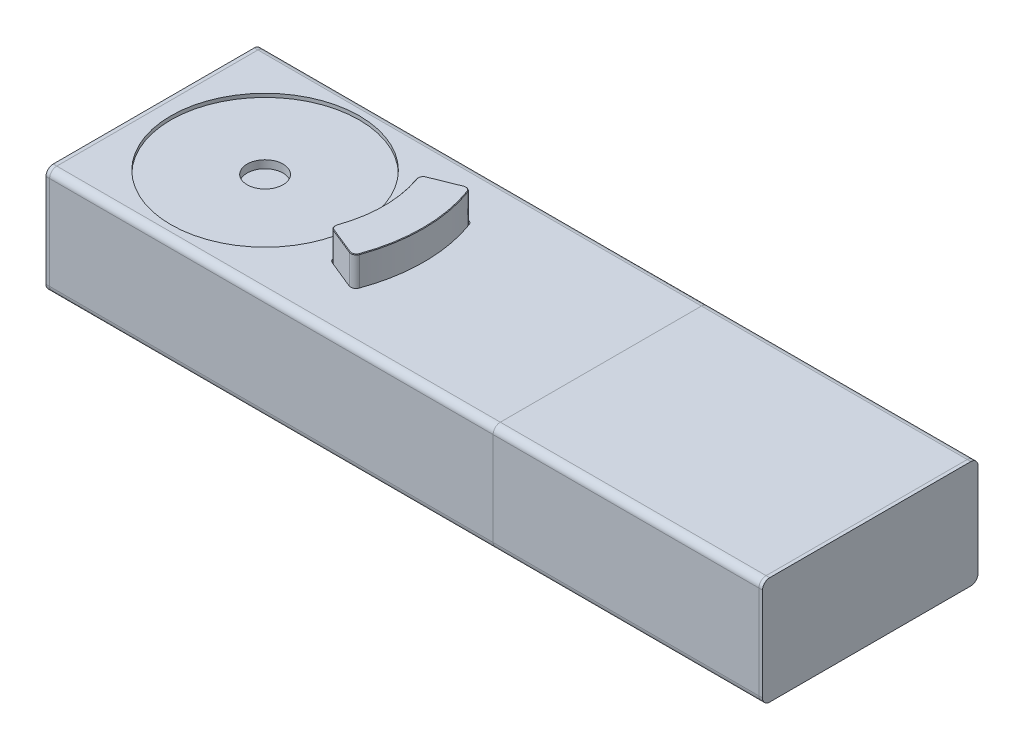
ISO-10303-21;
HEADER;
FILE_DESCRIPTION(('STEP AP214'),'2;1');
FILE_NAME('part.step','',(''),(''),'','','');
FILE_SCHEMA(('AUTOMOTIVE_DESIGN { 1 0 10303 214 1 1 1 1 }'));
ENDSEC;
DATA;
#1=APPLICATION_CONTEXT('core data for automotive mechanical design processes');
#2=APPLICATION_PROTOCOL_DEFINITION('international standard','automotive_design',2000,#1);
#3=PRODUCT_CONTEXT('',#1,'mechanical');
#4=PRODUCT('Part','Part','',(#3));
#5=PRODUCT_RELATED_PRODUCT_CATEGORY('part','',(#4));
#6=PRODUCT_DEFINITION_FORMATION('','',#4);
#7=PRODUCT_DEFINITION_CONTEXT('part definition',#1,'design');
#8=PRODUCT_DEFINITION('design','',#6,#7);
#9=PRODUCT_DEFINITION_SHAPE('','',#8);
#10=(LENGTH_UNIT() NAMED_UNIT(*) SI_UNIT(.MILLI.,.METRE.));
#11=(NAMED_UNIT(*) PLANE_ANGLE_UNIT() SI_UNIT($,.RADIAN.));
#12=(NAMED_UNIT(*) SI_UNIT($,.STERADIAN.) SOLID_ANGLE_UNIT());
#13=UNCERTAINTY_MEASURE_WITH_UNIT(LENGTH_MEASURE(1.E-05),#10,'distance_accuracy_value','');
#14=(GEOMETRIC_REPRESENTATION_CONTEXT(3) GLOBAL_UNCERTAINTY_ASSIGNED_CONTEXT((#13)) GLOBAL_UNIT_ASSIGNED_CONTEXT((#10,
#11,#12)) REPRESENTATION_CONTEXT('',''));
#15=CARTESIAN_POINT('',(0.,0.,0.));
#16=DIRECTION('',(0.,0.,1.));
#17=DIRECTION('',(1.,0.,0.));
#18=AXIS2_PLACEMENT_3D('',#15,#16,#17);
#19=CARTESIAN_POINT('',(330.,-29.,0.));
#20=DIRECTION('',(0.,-1.,0.));
#21=DIRECTION('',(0.,0.,-1.));
#22=AXIS2_PLACEMENT_3D('',#19,#20,#21);
#23=PLANE('',#22);
#24=CARTESIAN_POINT('',(330.,-29.,0.));
#25=DIRECTION('',(0.,-1.,0.));
#26=DIRECTION('',(0.,0.,-1.));
#27=AXIS2_PLACEMENT_3D('',#24,#25,#26);
#28=CIRCLE('',#27,42.6571779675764);
#29=CARTESIAN_POINT('',(330.,-29.,-42.6571779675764));
#30=VERTEX_POINT('',#29);
#31=EDGE_CURVE('P0_E20',#30,#30,#28,.T.);
#32=ORIENTED_EDGE('',*,*,#31,.T.);
#33=EDGE_LOOP('',(#32));
#34=FACE_BOUND('',#33,.T.);
#35=ADVANCED_FACE('P0_F17',(#34),#23,.T.);
#36=CARTESIAN_POINT('',(330.,-29.,0.));
#37=DIRECTION('',(0.,-1.,0.));
#38=DIRECTION('',(0.,0.,-1.));
#39=AXIS2_PLACEMENT_3D('',#36,#37,#38);
#40=CYLINDRICAL_SURFACE('',#39,42.6571779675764);
#41=ORIENTED_EDGE('',*,*,#31,.F.);
#42=EDGE_LOOP('',(#41));
#43=FACE_BOUND('',#42,.T.);
#44=CARTESIAN_POINT('',(330.,-30.,0.));
#45=DIRECTION('',(0.,-1.,0.));
#46=DIRECTION('',(0.,0.,-1.));
#47=AXIS2_PLACEMENT_3D('',#44,#45,#46);
#48=CIRCLE('',#47,42.6571779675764);
#49=CARTESIAN_POINT('',(330.,-30.,-42.6571779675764));
#50=VERTEX_POINT('',#49);
#51=EDGE_CURVE('P0_E127',#50,#50,#48,.T.);
#52=ORIENTED_EDGE('',*,*,#51,.T.);
#53=EDGE_LOOP('',(#52));
#54=FACE_BOUND('',#53,.T.);
#55=ADVANCED_FACE('P0_F145',(#43,#54),#40,.F.);
#56=CARTESIAN_POINT('',(390.,-26.,-60.));
#57=DIRECTION('',(0.,0.,1.));
#58=DIRECTION('',(1.,0.,0.));
#59=AXIS2_PLACEMENT_3D('',#56,#57,#58);
#60=PLANE('',#59);
#61=DIRECTION('',(-1.,0.,0.));
#62=VECTOR('',#61,1.);
#63=CARTESIAN_POINT('',(390.,26.,-60.));
#64=LINE('',#63,#62);
#65=CARTESIAN_POINT('',(390.,26.,-60.));
#66=VERTEX_POINT('',#65);
#67=CARTESIAN_POINT('',(242.,26.,-60.));
#68=VERTEX_POINT('',#67);
#69=EDGE_CURVE('P0_E90',#66,#68,#64,.T.);
#70=ORIENTED_EDGE('',*,*,#69,.F.);
#71=DIRECTION('',(0.,1.,0.));
#72=VECTOR('',#71,1.);
#73=CARTESIAN_POINT('',(390.,26.,-60.));
#74=LINE('',#73,#72);
#75=CARTESIAN_POINT('',(390.,-26.,-60.));
#76=VERTEX_POINT('',#75);
#77=EDGE_CURVE('P0_E87',#66,#76,#74,.F.);
#78=ORIENTED_EDGE('',*,*,#77,.T.);
#79=DIRECTION('',(-1.,0.,0.));
#80=VECTOR('',#79,1.);
#81=CARTESIAN_POINT('',(390.,-26.,-60.));
#82=LINE('',#81,#80);
#83=CARTESIAN_POINT('',(242.,-26.,-60.));
#84=VERTEX_POINT('',#83);
#85=EDGE_CURVE('P0_E128',#84,#76,#82,.F.);
#86=ORIENTED_EDGE('',*,*,#85,.F.);
#87=DIRECTION('',(0.,1.,0.));
#88=VECTOR('',#87,1.);
#89=CARTESIAN_POINT('',(242.,48.1057910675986,-60.));
#90=LINE('',#89,#88);
#91=EDGE_CURVE('P0_E136',#68,#84,#90,.F.);
#92=ORIENTED_EDGE('',*,*,#91,.F.);
#93=EDGE_LOOP('',(#70,#78,#86,#92));
#94=FACE_BOUND('',#93,.T.);
#95=ADVANCED_FACE('P0_F161',(#94),#60,.F.);
#96=CARTESIAN_POINT('',(390.,-26.,-56.));
#97=DIRECTION('',(-1.,0.,0.));
#98=DIRECTION('',(0.,0.,1.));
#99=AXIS2_PLACEMENT_3D('',#96,#97,#98);
#100=CYLINDRICAL_SURFACE('',#99,4.);
#101=ORIENTED_EDGE('',*,*,#85,.T.);
#102=CARTESIAN_POINT('',(390.,-26.,-56.));
#103=DIRECTION('',(-1.,0.,0.));
#104=DIRECTION('',(0.,0.,1.));
#105=AXIS2_PLACEMENT_3D('',#102,#103,#104);
#106=CIRCLE('',#105,4.);
#107=CARTESIAN_POINT('',(390.,-30.,-56.));
#108=VERTEX_POINT('',#107);
#109=EDGE_CURVE('P0_E115',#76,#108,#106,.T.);
#110=ORIENTED_EDGE('',*,*,#109,.T.);
#111=DIRECTION('',(1.,0.,0.));
#112=VECTOR('',#111,1.);
#113=CARTESIAN_POINT('',(390.,-30.,-56.));
#114=LINE('',#113,#112);
#115=CARTESIAN_POINT('',(242.,-30.,-56.));
#116=VERTEX_POINT('',#115);
#117=EDGE_CURVE('P0_E124',#108,#116,#114,.F.);
#118=ORIENTED_EDGE('',*,*,#117,.T.);
#119=CARTESIAN_POINT('',(242.,-26.,-56.));
#120=DIRECTION('',(-1.,0.,0.));
#121=DIRECTION('',(0.,0.,1.));
#122=AXIS2_PLACEMENT_3D('',#119,#120,#121);
#123=CIRCLE('',#122,4.);
#124=EDGE_CURVE('P0_E134',#84,#116,#123,.T.);
#125=ORIENTED_EDGE('',*,*,#124,.F.);
#126=EDGE_LOOP('',(#101,#110,#118,#125));
#127=FACE_BOUND('',#126,.T.);
#128=ADVANCED_FACE('P0_F150',(#127),#100,.T.);
#129=CARTESIAN_POINT('',(390.,-30.,56.));
#130=DIRECTION('',(0.,1.,0.));
#131=DIRECTION('',(0.,0.,1.));
#132=AXIS2_PLACEMENT_3D('',#129,#130,#131);
#133=PLANE('',#132);
#134=ORIENTED_EDGE('',*,*,#117,.F.);
#135=DIRECTION('',(0.,0.,1.));
#136=VECTOR('',#135,1.);
#137=CARTESIAN_POINT('',(390.,-30.,56.));
#138=LINE('',#137,#136);
#139=CARTESIAN_POINT('',(390.,-30.,56.));
#140=VERTEX_POINT('',#139);
#141=EDGE_CURVE('P0_E112',#108,#140,#138,.T.);
#142=ORIENTED_EDGE('',*,*,#141,.T.);
#143=DIRECTION('',(-1.,0.,0.));
#144=VECTOR('',#143,1.);
#145=CARTESIAN_POINT('',(390.,-30.,56.));
#146=LINE('',#145,#144);
#147=CARTESIAN_POINT('',(242.,-30.,56.));
#148=VERTEX_POINT('',#147);
#149=EDGE_CURVE('P0_E122',#148,#140,#146,.F.);
#150=ORIENTED_EDGE('',*,*,#149,.F.);
#151=DIRECTION('',(0.,0.,1.));
#152=VECTOR('',#151,1.);
#153=CARTESIAN_POINT('',(242.,-30.,-128.014994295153));
#154=LINE('',#153,#152);
#155=EDGE_CURVE('P0_E133',#116,#148,#154,.T.);
#156=ORIENTED_EDGE('',*,*,#155,.F.);
#157=EDGE_LOOP('',(#134,#142,#150,#156));
#158=FACE_BOUND('',#157,.T.);
#159=ORIENTED_EDGE('',*,*,#51,.F.);
#160=EDGE_LOOP('',(#159));
#161=FACE_BOUND('',#160,.T.);
#162=ADVANCED_FACE('P0_F147',(#158,#161),#133,.F.);
#163=CARTESIAN_POINT('',(390.,-26.,56.));
#164=DIRECTION('',(-1.,0.,0.));
#165=DIRECTION('',(0.,0.,1.));
#166=AXIS2_PLACEMENT_3D('',#163,#164,#165);
#167=CYLINDRICAL_SURFACE('',#166,4.);
#168=ORIENTED_EDGE('',*,*,#149,.T.);
#169=CARTESIAN_POINT('',(390.,-26.,56.));
#170=DIRECTION('',(-1.,0.,0.));
#171=DIRECTION('',(0.,0.,1.));
#172=AXIS2_PLACEMENT_3D('',#169,#170,#171);
#173=CIRCLE('',#172,4.);
#174=CARTESIAN_POINT('',(390.,-26.,60.));
#175=VERTEX_POINT('',#174);
#176=EDGE_CURVE('P0_E111',#140,#175,#173,.T.);
#177=ORIENTED_EDGE('',*,*,#176,.T.);
#178=DIRECTION('',(-1.,0.,0.));
#179=VECTOR('',#178,1.);
#180=CARTESIAN_POINT('',(390.,-26.,60.));
#181=LINE('',#180,#179);
#182=CARTESIAN_POINT('',(242.,-26.,60.));
#183=VERTEX_POINT('',#182);
#184=EDGE_CURVE('P0_E119',#175,#183,#181,.T.);
#185=ORIENTED_EDGE('',*,*,#184,.T.);
#186=CARTESIAN_POINT('',(242.,-26.,56.));
#187=DIRECTION('',(-1.,0.,0.));
#188=DIRECTION('',(0.,0.,1.));
#189=AXIS2_PLACEMENT_3D('',#186,#187,#188);
#190=CIRCLE('',#189,4.);
#191=EDGE_CURVE('P0_E131',#148,#183,#190,.T.);
#192=ORIENTED_EDGE('',*,*,#191,.F.);
#193=EDGE_LOOP('',(#168,#177,#185,#192));
#194=FACE_BOUND('',#193,.T.);
#195=ADVANCED_FACE('P0_F149',(#194),#167,.T.);
#196=CARTESIAN_POINT('',(390.,-26.,60.));
#197=DIRECTION('',(0.,0.,-1.));
#198=DIRECTION('',(-1.,0.,0.));
#199=AXIS2_PLACEMENT_3D('',#196,#197,#198);
#200=PLANE('',#199);
#201=ORIENTED_EDGE('',*,*,#184,.F.);
#202=DIRECTION('',(0.,1.,0.));
#203=VECTOR('',#202,1.);
#204=CARTESIAN_POINT('',(390.,26.,60.));
#205=LINE('',#204,#203);
#206=CARTESIAN_POINT('',(390.,26.,60.));
#207=VERTEX_POINT('',#206);
#208=EDGE_CURVE('P0_E107',#175,#207,#205,.T.);
#209=ORIENTED_EDGE('',*,*,#208,.T.);
#210=DIRECTION('',(-1.,0.,0.));
#211=VECTOR('',#210,1.);
#212=CARTESIAN_POINT('',(390.,26.,60.));
#213=LINE('',#212,#211);
#214=CARTESIAN_POINT('',(242.,26.,60.));
#215=VERTEX_POINT('',#214);
#216=EDGE_CURVE('P0_E110',#215,#207,#213,.F.);
#217=ORIENTED_EDGE('',*,*,#216,.F.);
#218=DIRECTION('',(0.,1.,0.));
#219=VECTOR('',#218,1.);
#220=CARTESIAN_POINT('',(242.,48.1057910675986,60.));
#221=LINE('',#220,#219);
#222=EDGE_CURVE('P0_E103',#183,#215,#221,.T.);
#223=ORIENTED_EDGE('',*,*,#222,.F.);
#224=EDGE_LOOP('',(#201,#209,#217,#223));
#225=FACE_BOUND('',#224,.T.);
#226=ADVANCED_FACE('P0_F158',(#225),#200,.F.);
#227=CARTESIAN_POINT('',(390.,26.,-56.));
#228=DIRECTION('',(-1.,0.,0.));
#229=DIRECTION('',(0.,0.,1.));
#230=AXIS2_PLACEMENT_3D('',#227,#228,#229);
#231=CYLINDRICAL_SURFACE('',#230,4.);
#232=DIRECTION('',(1.,0.,0.));
#233=VECTOR('',#232,1.);
#234=CARTESIAN_POINT('',(390.,30.,-56.));
#235=LINE('',#234,#233);
#236=CARTESIAN_POINT('',(242.,30.,-56.));
#237=VERTEX_POINT('',#236);
#238=CARTESIAN_POINT('',(390.,30.,-56.));
#239=VERTEX_POINT('',#238);
#240=EDGE_CURVE('P0_E95',#237,#239,#235,.T.);
#241=ORIENTED_EDGE('',*,*,#240,.T.);
#242=CARTESIAN_POINT('',(390.,26.,-56.));
#243=DIRECTION('',(-1.,0.,0.));
#244=DIRECTION('',(0.,0.,1.));
#245=AXIS2_PLACEMENT_3D('',#242,#243,#244);
#246=CIRCLE('',#245,4.);
#247=EDGE_CURVE('P0_E79',#239,#66,#246,.T.);
#248=ORIENTED_EDGE('',*,*,#247,.T.);
#249=ORIENTED_EDGE('',*,*,#69,.T.);
#250=CARTESIAN_POINT('',(242.,26.,-56.));
#251=DIRECTION('',(-1.,0.,0.));
#252=DIRECTION('',(0.,0.,1.));
#253=AXIS2_PLACEMENT_3D('',#250,#251,#252);
#254=CIRCLE('',#253,4.);
#255=EDGE_CURVE('P0_E101',#237,#68,#254,.T.);
#256=ORIENTED_EDGE('',*,*,#255,.F.);
#257=EDGE_LOOP('',(#241,#248,#249,#256));
#258=FACE_BOUND('',#257,.T.);
#259=ADVANCED_FACE('P0_F99',(#258),#231,.T.);
#260=CARTESIAN_POINT('',(390.,26.,56.));
#261=DIRECTION('',(-1.,0.,0.));
#262=DIRECTION('',(0.,0.,1.));
#263=AXIS2_PLACEMENT_3D('',#260,#261,#262);
#264=PLANE('',#263);
#265=ORIENTED_EDGE('',*,*,#176,.F.);
#266=ORIENTED_EDGE('',*,*,#141,.F.);
#267=ORIENTED_EDGE('',*,*,#109,.F.);
#268=ORIENTED_EDGE('',*,*,#77,.F.);
#269=ORIENTED_EDGE('',*,*,#247,.F.);
#270=DIRECTION('',(0.,0.,-1.));
#271=VECTOR('',#270,1.);
#272=CARTESIAN_POINT('',(390.,30.,56.));
#273=LINE('',#272,#271);
#274=CARTESIAN_POINT('',(390.,30.,56.));
#275=VERTEX_POINT('',#274);
#276=EDGE_CURVE('P0_E84',#239,#275,#273,.F.);
#277=ORIENTED_EDGE('',*,*,#276,.T.);
#278=CARTESIAN_POINT('',(390.,26.,56.));
#279=DIRECTION('',(-1.,0.,0.));
#280=DIRECTION('',(0.,0.,1.));
#281=AXIS2_PLACEMENT_3D('',#278,#279,#280);
#282=CIRCLE('',#281,4.);
#283=EDGE_CURVE('P0_E118',#207,#275,#282,.T.);
#284=ORIENTED_EDGE('',*,*,#283,.F.);
#285=ORIENTED_EDGE('',*,*,#208,.F.);
#286=EDGE_LOOP('',(#265,#266,#267,#268,#269,#277,#284,#285));
#287=FACE_BOUND('',#286,.T.);
#288=ADVANCED_FACE('P0_F82',(#287),#264,.F.);
#289=CARTESIAN_POINT('',(390.,26.,56.));
#290=DIRECTION('',(-1.,0.,0.));
#291=DIRECTION('',(0.,0.,1.));
#292=AXIS2_PLACEMENT_3D('',#289,#290,#291);
#293=CYLINDRICAL_SURFACE('',#292,4.);
#294=ORIENTED_EDGE('',*,*,#216,.T.);
#295=ORIENTED_EDGE('',*,*,#283,.T.);
#296=DIRECTION('',(1.,0.,0.));
#297=VECTOR('',#296,1.);
#298=CARTESIAN_POINT('',(390.,30.,56.));
#299=LINE('',#298,#297);
#300=CARTESIAN_POINT('',(242.,30.,56.));
#301=VERTEX_POINT('',#300);
#302=EDGE_CURVE('P0_E26',#275,#301,#299,.F.);
#303=ORIENTED_EDGE('',*,*,#302,.T.);
#304=CARTESIAN_POINT('',(242.,26.,56.));
#305=DIRECTION('',(-1.,0.,0.));
#306=DIRECTION('',(0.,0.,1.));
#307=AXIS2_PLACEMENT_3D('',#304,#305,#306);
#308=CIRCLE('',#307,4.);
#309=EDGE_CURVE('P0_E34',#215,#301,#308,.T.);
#310=ORIENTED_EDGE('',*,*,#309,.F.);
#311=EDGE_LOOP('',(#294,#295,#303,#310));
#312=FACE_BOUND('',#311,.T.);
#313=ADVANCED_FACE('P0_F170',(#312),#293,.T.);
#314=CARTESIAN_POINT('',(242.,48.1057910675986,-128.014994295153));
#315=DIRECTION('',(-1.,0.,0.));
#316=DIRECTION('',(0.,0.,1.));
#317=AXIS2_PLACEMENT_3D('',#314,#315,#316);
#318=PLANE('',#317);
#319=ORIENTED_EDGE('',*,*,#222,.T.);
#320=ORIENTED_EDGE('',*,*,#309,.T.);
#321=DIRECTION('',(0.,0.,-1.));
#322=VECTOR('',#321,1.);
#323=CARTESIAN_POINT('',(242.,30.,56.));
#324=LINE('',#323,#322);
#325=EDGE_CURVE('P0_E11',#301,#237,#324,.T.);
#326=ORIENTED_EDGE('',*,*,#325,.T.);
#327=ORIENTED_EDGE('',*,*,#255,.T.);
#328=ORIENTED_EDGE('',*,*,#91,.T.);
#329=ORIENTED_EDGE('',*,*,#124,.T.);
#330=ORIENTED_EDGE('',*,*,#155,.T.);
#331=ORIENTED_EDGE('',*,*,#191,.T.);
#332=EDGE_LOOP('',(#319,#320,#326,#327,#328,#329,#330,#331));
#333=FACE_BOUND('',#332,.T.);
#334=ADVANCED_FACE('P0_F165',(#333),#318,.T.);
#335=CARTESIAN_POINT('',(390.,30.,56.));
#336=DIRECTION('',(0.,-1.,0.));
#337=DIRECTION('',(0.,0.,-1.));
#338=AXIS2_PLACEMENT_3D('',#335,#336,#337);
#339=PLANE('',#338);
#340=ORIENTED_EDGE('',*,*,#302,.F.);
#341=ORIENTED_EDGE('',*,*,#276,.F.);
#342=ORIENTED_EDGE('',*,*,#240,.F.);
#343=ORIENTED_EDGE('',*,*,#325,.F.);
#344=EDGE_LOOP('',(#340,#341,#342,#343));
#345=FACE_BOUND('',#344,.T.);
#346=ADVANCED_FACE('P0_F94',(#345),#339,.F.);
#347=CLOSED_SHELL('',(#35,#55,#95,#128,#162,#195,#226,#259,#288,#313,#334,#346));
#348=MANIFOLD_SOLID_BREP('P0_B1',#347);
#349=CARTESIAN_POINT('',(-5.,26.,56.));
#350=DIRECTION('',(-1.,0.,0.));
#351=DIRECTION('',(0.,0.,1.));
#352=AXIS2_PLACEMENT_3D('',#349,#350,#351);
#353=PLANE('',#352);
#354=CARTESIAN_POINT('',(-5.,-26.,56.));
#355=DIRECTION('',(-1.,0.,0.));
#356=DIRECTION('',(0.,0.,1.));
#357=AXIS2_PLACEMENT_3D('',#354,#355,#356);
#358=CIRCLE('',#357,4.);
#359=CARTESIAN_POINT('',(-5.,-30.,56.));
#360=VERTEX_POINT('',#359);
#361=CARTESIAN_POINT('',(-5.,-26.,60.));
#362=VERTEX_POINT('',#361);
#363=EDGE_CURVE('P1_E20',#360,#362,#358,.T.);
#364=ORIENTED_EDGE('',*,*,#363,.F.);
#365=DIRECTION('',(0.,0.,1.));
#366=VECTOR('',#365,1.);
#367=CARTESIAN_POINT('',(-5.,-30.,56.));
#368=LINE('',#367,#366);
#369=CARTESIAN_POINT('',(-5.,-30.,-56.));
#370=VERTEX_POINT('',#369);
#371=EDGE_CURVE('P1_E82',#360,#370,#368,.F.);
#372=ORIENTED_EDGE('',*,*,#371,.T.);
#373=CARTESIAN_POINT('',(-5.,-26.,-56.));
#374=DIRECTION('',(-1.,0.,0.));
#375=DIRECTION('',(0.,0.,1.));
#376=AXIS2_PLACEMENT_3D('',#373,#374,#375);
#377=CIRCLE('',#376,4.);
#378=CARTESIAN_POINT('',(-5.,-26.,-60.));
#379=VERTEX_POINT('',#378);
#380=EDGE_CURVE('P1_E123',#379,#370,#377,.T.);
#381=ORIENTED_EDGE('',*,*,#380,.F.);
#382=DIRECTION('',(0.,1.,0.));
#383=VECTOR('',#382,1.);
#384=CARTESIAN_POINT('',(-5.,-26.,-60.));
#385=LINE('',#384,#383);
#386=CARTESIAN_POINT('',(-5.,26.,-60.));
#387=VERTEX_POINT('',#386);
#388=EDGE_CURVE('P1_E102',#379,#387,#385,.T.);
#389=ORIENTED_EDGE('',*,*,#388,.T.);
#390=CARTESIAN_POINT('',(-5.,26.,-56.));
#391=DIRECTION('',(-1.,0.,0.));
#392=DIRECTION('',(0.,0.,1.));
#393=AXIS2_PLACEMENT_3D('',#390,#391,#392);
#394=CIRCLE('',#393,4.);
#395=CARTESIAN_POINT('',(-5.,30.,-56.));
#396=VERTEX_POINT('',#395);
#397=EDGE_CURVE('P1_E125',#396,#387,#394,.T.);
#398=ORIENTED_EDGE('',*,*,#397,.F.);
#399=DIRECTION('',(0.,0.,-1.));
#400=VECTOR('',#399,1.);
#401=CARTESIAN_POINT('',(-5.,30.,56.));
#402=LINE('',#401,#400);
#403=CARTESIAN_POINT('',(-5.,30.,56.));
#404=VERTEX_POINT('',#403);
#405=EDGE_CURVE('P1_E106',#396,#404,#402,.F.);
#406=ORIENTED_EDGE('',*,*,#405,.T.);
#407=CARTESIAN_POINT('',(-5.,26.,56.));
#408=DIRECTION('',(-1.,0.,0.));
#409=DIRECTION('',(0.,0.,1.));
#410=AXIS2_PLACEMENT_3D('',#407,#408,#409);
#411=CIRCLE('',#410,4.);
#412=CARTESIAN_POINT('',(-5.,26.,60.));
#413=VERTEX_POINT('',#412);
#414=EDGE_CURVE('P1_E127',#413,#404,#411,.T.);
#415=ORIENTED_EDGE('',*,*,#414,.F.);
#416=DIRECTION('',(0.,1.,0.));
#417=VECTOR('',#416,1.);
#418=CARTESIAN_POINT('',(-5.,-26.,60.));
#419=LINE('',#418,#417);
#420=EDGE_CURVE('P1_E84',#413,#362,#419,.F.);
#421=ORIENTED_EDGE('',*,*,#420,.T.);
#422=EDGE_LOOP('',(#364,#372,#381,#389,#398,#406,#415,#421));
#423=FACE_BOUND('',#422,.T.);
#424=ADVANCED_FACE('P1_F17',(#423),#353,.F.);
#425=CARTESIAN_POINT('',(-5.,-26.,56.));
#426=DIRECTION('',(-1.,0.,0.));
#427=DIRECTION('',(0.,0.,1.));
#428=AXIS2_PLACEMENT_3D('',#425,#426,#427);
#429=CYLINDRICAL_SURFACE('',#428,4.);
#430=CARTESIAN_POINT('',(-7.,-26.,56.));
#431=DIRECTION('',(-1.,0.,0.));
#432=DIRECTION('',(0.,0.,1.));
#433=AXIS2_PLACEMENT_3D('',#430,#431,#432);
#434=CIRCLE('',#433,4.);
#435=CARTESIAN_POINT('',(-7.,-30.,56.));
#436=VERTEX_POINT('',#435);
#437=CARTESIAN_POINT('',(-7.,-26.,60.));
#438=VERTEX_POINT('',#437);
#439=EDGE_CURVE('P1_E91',#436,#438,#434,.T.);
#440=ORIENTED_EDGE('',*,*,#439,.F.);
#441=DIRECTION('',(1.,0.,0.));
#442=VECTOR('',#441,1.);
#443=CARTESIAN_POINT('',(-5.,-30.,56.));
#444=LINE('',#443,#442);
#445=EDGE_CURVE('P1_E88',#436,#360,#444,.T.);
#446=ORIENTED_EDGE('',*,*,#445,.T.);
#447=ORIENTED_EDGE('',*,*,#363,.T.);
#448=DIRECTION('',(-1.,0.,0.));
#449=VECTOR('',#448,1.);
#450=CARTESIAN_POINT('',(-5.,-26.,60.));
#451=LINE('',#450,#449);
#452=EDGE_CURVE('P1_E100',#362,#438,#451,.T.);
#453=ORIENTED_EDGE('',*,*,#452,.T.);
#454=EDGE_LOOP('',(#440,#446,#447,#453));
#455=FACE_BOUND('',#454,.T.);
#456=ADVANCED_FACE('P1_F89',(#455),#429,.T.);
#457=CARTESIAN_POINT('',(-5.,-26.,60.));
#458=DIRECTION('',(0.,0.,-1.));
#459=DIRECTION('',(-1.,0.,0.));
#460=AXIS2_PLACEMENT_3D('',#457,#458,#459);
#461=PLANE('',#460);
#462=ORIENTED_EDGE('',*,*,#420,.F.);
#463=DIRECTION('',(-1.,0.,0.));
#464=VECTOR('',#463,1.);
#465=CARTESIAN_POINT('',(-5.,26.,60.));
#466=LINE('',#465,#464);
#467=CARTESIAN_POINT('',(-7.,26.,60.));
#468=VERTEX_POINT('',#467);
#469=EDGE_CURVE('P1_E109',#468,#413,#466,.F.);
#470=ORIENTED_EDGE('',*,*,#469,.F.);
#471=DIRECTION('',(0.,1.,0.));
#472=VECTOR('',#471,1.);
#473=CARTESIAN_POINT('',(-7.,26.,60.));
#474=LINE('',#473,#472);
#475=EDGE_CURVE('P1_E121',#438,#468,#474,.T.);
#476=ORIENTED_EDGE('',*,*,#475,.F.);
#477=ORIENTED_EDGE('',*,*,#452,.F.);
#478=EDGE_LOOP('',(#462,#470,#476,#477));
#479=FACE_BOUND('',#478,.T.);
#480=ADVANCED_FACE('P1_F135',(#479),#461,.F.);
#481=CARTESIAN_POINT('',(-5.,26.,56.));
#482=DIRECTION('',(-1.,0.,0.));
#483=DIRECTION('',(0.,0.,1.));
#484=AXIS2_PLACEMENT_3D('',#481,#482,#483);
#485=CYLINDRICAL_SURFACE('',#484,4.);
#486=CARTESIAN_POINT('',(-7.,26.,56.));
#487=DIRECTION('',(-1.,0.,0.));
#488=DIRECTION('',(0.,0.,1.));
#489=AXIS2_PLACEMENT_3D('',#486,#487,#488);
#490=CIRCLE('',#489,4.);
#491=CARTESIAN_POINT('',(-7.,30.,56.));
#492=VERTEX_POINT('',#491);
#493=EDGE_CURVE('P1_E118',#468,#492,#490,.T.);
#494=ORIENTED_EDGE('',*,*,#493,.F.);
#495=ORIENTED_EDGE('',*,*,#469,.T.);
#496=ORIENTED_EDGE('',*,*,#414,.T.);
#497=DIRECTION('',(1.,0.,0.));
#498=VECTOR('',#497,1.);
#499=CARTESIAN_POINT('',(-5.,30.,56.));
#500=LINE('',#499,#498);
#501=EDGE_CURVE('P1_E108',#404,#492,#500,.F.);
#502=ORIENTED_EDGE('',*,*,#501,.T.);
#503=EDGE_LOOP('',(#494,#495,#496,#502));
#504=FACE_BOUND('',#503,.T.);
#505=ADVANCED_FACE('P1_F152',(#504),#485,.T.);
#506=CARTESIAN_POINT('',(-5.,30.,56.));
#507=DIRECTION('',(0.,-1.,0.));
#508=DIRECTION('',(0.,0.,-1.));
#509=AXIS2_PLACEMENT_3D('',#506,#507,#508);
#510=PLANE('',#509);
#511=ORIENTED_EDGE('',*,*,#405,.F.);
#512=DIRECTION('',(-1.,0.,0.));
#513=VECTOR('',#512,1.);
#514=CARTESIAN_POINT('',(-5.,30.,-56.));
#515=LINE('',#514,#513);
#516=CARTESIAN_POINT('',(-7.,30.,-56.));
#517=VERTEX_POINT('',#516);
#518=EDGE_CURVE('P1_E105',#517,#396,#515,.F.);
#519=ORIENTED_EDGE('',*,*,#518,.F.);
#520=DIRECTION('',(0.,0.,1.));
#521=VECTOR('',#520,1.);
#522=CARTESIAN_POINT('',(-7.,30.,56.));
#523=LINE('',#522,#521);
#524=EDGE_CURVE('P1_E117',#492,#517,#523,.F.);
#525=ORIENTED_EDGE('',*,*,#524,.F.);
#526=ORIENTED_EDGE('',*,*,#501,.F.);
#527=EDGE_LOOP('',(#511,#519,#525,#526));
#528=FACE_BOUND('',#527,.T.);
#529=ADVANCED_FACE('P1_F156',(#528),#510,.F.);
#530=CARTESIAN_POINT('',(-5.,26.,-56.));
#531=DIRECTION('',(-1.,0.,0.));
#532=DIRECTION('',(0.,0.,1.));
#533=AXIS2_PLACEMENT_3D('',#530,#531,#532);
#534=CYLINDRICAL_SURFACE('',#533,4.);
#535=CARTESIAN_POINT('',(-7.,26.,-56.));
#536=DIRECTION('',(-1.,0.,0.));
#537=DIRECTION('',(0.,0.,1.));
#538=AXIS2_PLACEMENT_3D('',#535,#536,#537);
#539=CIRCLE('',#538,4.);
#540=CARTESIAN_POINT('',(-7.,26.,-60.));
#541=VERTEX_POINT('',#540);
#542=EDGE_CURVE('P1_E114',#517,#541,#539,.T.);
#543=ORIENTED_EDGE('',*,*,#542,.F.);
#544=ORIENTED_EDGE('',*,*,#518,.T.);
#545=ORIENTED_EDGE('',*,*,#397,.T.);
#546=DIRECTION('',(1.,0.,0.));
#547=VECTOR('',#546,1.);
#548=CARTESIAN_POINT('',(-5.,26.,-60.));
#549=LINE('',#548,#547);
#550=EDGE_CURVE('P1_E104',#387,#541,#549,.F.);
#551=ORIENTED_EDGE('',*,*,#550,.T.);
#552=EDGE_LOOP('',(#543,#544,#545,#551));
#553=FACE_BOUND('',#552,.T.);
#554=ADVANCED_FACE('P1_F161',(#553),#534,.T.);
#555=CARTESIAN_POINT('',(-5.,-26.,-60.));
#556=DIRECTION('',(0.,0.,1.));
#557=DIRECTION('',(1.,0.,0.));
#558=AXIS2_PLACEMENT_3D('',#555,#556,#557);
#559=PLANE('',#558);
#560=ORIENTED_EDGE('',*,*,#388,.F.);
#561=DIRECTION('',(-1.,0.,0.));
#562=VECTOR('',#561,1.);
#563=CARTESIAN_POINT('',(-5.,-26.,-60.));
#564=LINE('',#563,#562);
#565=CARTESIAN_POINT('',(-7.,-26.,-60.));
#566=VERTEX_POINT('',#565);
#567=EDGE_CURVE('P1_E93',#566,#379,#564,.F.);
#568=ORIENTED_EDGE('',*,*,#567,.F.);
#569=DIRECTION('',(0.,1.,0.));
#570=VECTOR('',#569,1.);
#571=CARTESIAN_POINT('',(-7.,26.,-60.));
#572=LINE('',#571,#570);
#573=EDGE_CURVE('P1_E113',#541,#566,#572,.F.);
#574=ORIENTED_EDGE('',*,*,#573,.F.);
#575=ORIENTED_EDGE('',*,*,#550,.F.);
#576=EDGE_LOOP('',(#560,#568,#574,#575));
#577=FACE_BOUND('',#576,.T.);
#578=ADVANCED_FACE('P1_F163',(#577),#559,.F.);
#579=CARTESIAN_POINT('',(-5.,-26.,-56.));
#580=DIRECTION('',(-1.,0.,0.));
#581=DIRECTION('',(0.,0.,1.));
#582=AXIS2_PLACEMENT_3D('',#579,#580,#581);
#583=CYLINDRICAL_SURFACE('',#582,4.);
#584=CARTESIAN_POINT('',(-7.,-26.,-56.));
#585=DIRECTION('',(-1.,0.,0.));
#586=DIRECTION('',(0.,0.,1.));
#587=AXIS2_PLACEMENT_3D('',#584,#585,#586);
#588=CIRCLE('',#587,4.);
#589=CARTESIAN_POINT('',(-7.,-30.,-56.));
#590=VERTEX_POINT('',#589);
#591=EDGE_CURVE('P1_E26',#566,#590,#588,.T.);
#592=ORIENTED_EDGE('',*,*,#591,.F.);
#593=ORIENTED_EDGE('',*,*,#567,.T.);
#594=ORIENTED_EDGE('',*,*,#380,.T.);
#595=DIRECTION('',(1.,0.,0.));
#596=VECTOR('',#595,1.);
#597=CARTESIAN_POINT('',(-5.,-30.,-56.));
#598=LINE('',#597,#596);
#599=EDGE_CURVE('P1_E35',#370,#590,#598,.F.);
#600=ORIENTED_EDGE('',*,*,#599,.T.);
#601=EDGE_LOOP('',(#592,#593,#594,#600));
#602=FACE_BOUND('',#601,.T.);
#603=ADVANCED_FACE('P1_F143',(#602),#583,.T.);
#604=CARTESIAN_POINT('',(-5.,-30.,56.));
#605=DIRECTION('',(0.,1.,0.));
#606=DIRECTION('',(0.,0.,1.));
#607=AXIS2_PLACEMENT_3D('',#604,#605,#606);
#608=PLANE('',#607);
#609=ORIENTED_EDGE('',*,*,#371,.F.);
#610=ORIENTED_EDGE('',*,*,#445,.F.);
#611=DIRECTION('',(0.,0.,1.));
#612=VECTOR('',#611,1.);
#613=CARTESIAN_POINT('',(-7.,-30.,56.));
#614=LINE('',#613,#612);
#615=EDGE_CURVE('P1_E11',#590,#436,#614,.T.);
#616=ORIENTED_EDGE('',*,*,#615,.F.);
#617=ORIENTED_EDGE('',*,*,#599,.F.);
#618=EDGE_LOOP('',(#609,#610,#616,#617));
#619=FACE_BOUND('',#618,.T.);
#620=ADVANCED_FACE('P1_F95',(#619),#608,.F.);
#621=CARTESIAN_POINT('',(-7.,26.,56.));
#622=DIRECTION('',(-1.,0.,0.));
#623=DIRECTION('',(0.,0.,1.));
#624=AXIS2_PLACEMENT_3D('',#621,#622,#623);
#625=PLANE('',#624);
#626=ORIENTED_EDGE('',*,*,#591,.T.);
#627=ORIENTED_EDGE('',*,*,#615,.T.);
#628=ORIENTED_EDGE('',*,*,#439,.T.);
#629=ORIENTED_EDGE('',*,*,#475,.T.);
#630=ORIENTED_EDGE('',*,*,#493,.T.);
#631=ORIENTED_EDGE('',*,*,#524,.T.);
#632=ORIENTED_EDGE('',*,*,#542,.T.);
#633=ORIENTED_EDGE('',*,*,#573,.T.);
#634=EDGE_LOOP('',(#626,#627,#628,#629,#630,#631,#632,#633));
#635=FACE_BOUND('',#634,.T.);
#636=ADVANCED_FACE('P1_F139',(#635),#625,.T.);
#637=CLOSED_SHELL('',(#424,#456,#480,#505,#529,#554,#578,#603,#620,#636));
#638=MANIFOLD_SOLID_BREP('P1_B1',#637);
#639=CARTESIAN_POINT('',(55.,46.,0.));
#640=DIRECTION('',(0.,1.,0.));
#641=DIRECTION('',(0.,0.,1.));
#642=AXIS2_PLACEMENT_3D('',#639,#640,#641);
#643=PLANE('',#642);
#644=DIRECTION('',(0.927183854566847,1.60338755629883E-13,-0.374606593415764));
#645=VECTOR('',#644,1.);
#646=CARTESIAN_POINT('',(119.02757082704,46.0000000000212,-25.5452573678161));
#647=LINE('',#646,#645);
#648=CARTESIAN_POINT('',(119.027570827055,45.9999999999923,-25.5452573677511));
#649=VERTEX_POINT('',#648);
#650=CARTESIAN_POINT('',(133.873908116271,46.0000000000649,-31.5435669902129));
#651=VERTEX_POINT('',#650);
#652=EDGE_CURVE('P2_E117',#649,#651,#647,.T.);
#653=ORIENTED_EDGE('',*,*,#652,.F.);
#654=CARTESIAN_POINT('',(120.039008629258,45.9999999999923,-23.0418609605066));
#655=DIRECTION('',(0.,-1.,0.));
#656=DIRECTION('',(0.,0.,-1.));
#657=AXIS2_PLACEMENT_3D('',#654,#655,#656);
#658=CIRCLE('',#657,2.69999999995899);
#659=CARTESIAN_POINT('',(117.494003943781,45.9999999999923,-22.1402229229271));
#660=VERTEX_POINT('',#659);
#661=EDGE_CURVE('P2_E120',#660,#649,#658,.T.);
#662=ORIENTED_EDGE('',*,*,#661,.F.);
#663=CARTESIAN_POINT('',(55.,45.9999999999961,0.));
#664=DIRECTION('',(0.,1.,0.));
#665=DIRECTION('',(0.,0.,1.));
#666=AXIS2_PLACEMENT_3D('',#663,#664,#665);
#667=CIRCLE('',#666,66.2999999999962);
#668=CARTESIAN_POINT('',(117.494003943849,45.9999999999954,22.1402229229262));
#669=VERTEX_POINT('',#668);
#670=EDGE_CURVE('P2_E140',#660,#669,#667,.F.);
#671=ORIENTED_EDGE('',*,*,#670,.T.);
#672=CARTESIAN_POINT('',(120.039008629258,45.9999999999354,23.0418609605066));
#673=DIRECTION('',(0.,-1.,0.));
#674=DIRECTION('',(0.,0.,-1.));
#675=AXIS2_PLACEMENT_3D('',#672,#673,#674);
#676=CIRCLE('',#675,2.6999999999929);
#677=CARTESIAN_POINT('',(119.027570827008,45.9999999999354,25.5452573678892));
#678=VERTEX_POINT('',#677);
#679=EDGE_CURVE('P2_E108',#678,#669,#676,.T.);
#680=ORIENTED_EDGE('',*,*,#679,.F.);
#681=DIRECTION('',(-0.927183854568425,-4.3729145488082E-12,-0.374606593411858));
#682=VECTOR('',#681,1.);
#683=CARTESIAN_POINT('',(133.873908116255,46.0000000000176,31.5435669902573));
#684=LINE('',#683,#682);
#685=CARTESIAN_POINT('',(133.873908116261,46.0000000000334,31.5435669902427));
#686=VERTEX_POINT('',#685);
#687=EDGE_CURVE('P2_E100',#686,#678,#684,.T.);
#688=ORIENTED_EDGE('',*,*,#687,.F.);
#689=CARTESIAN_POINT('',(134.88534591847,46.0000000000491,29.0401705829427));
#690=DIRECTION('',(0.,-1.,0.));
#691=DIRECTION('',(0.,0.,-1.));
#692=AXIS2_PLACEMENT_3D('',#689,#690,#691);
#693=CIRCLE('',#692,2.69999999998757);
#694=CARTESIAN_POINT('',(137.422880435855,46.0000000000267,29.9626230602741));
#695=VERTEX_POINT('',#694);
#696=EDGE_CURVE('P2_E20',#695,#686,#693,.T.);
#697=ORIENTED_EDGE('',*,*,#696,.F.);
#698=CARTESIAN_POINT('',(55.,46.0000000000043,0.));
#699=DIRECTION('',(0.,-1.,0.));
#700=DIRECTION('',(0.,0.,-1.));
#701=AXIS2_PLACEMENT_3D('',#698,#699,#700);
#702=CIRCLE('',#701,87.6999999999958);
#703=CARTESIAN_POINT('',(137.422880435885,46.0000000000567,-29.9626230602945));
#704=VERTEX_POINT('',#703);
#705=EDGE_CURVE('P2_E96',#704,#695,#702,.T.);
#706=ORIENTED_EDGE('',*,*,#705,.F.);
#707=CARTESIAN_POINT('',(134.88534591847,46.000000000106,-29.0401705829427));
#708=DIRECTION('',(0.,-1.,0.));
#709=DIRECTION('',(0.,0.,-1.));
#710=AXIS2_PLACEMENT_3D('',#707,#708,#709);
#711=CIRCLE('',#710,2.70000000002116);
#712=EDGE_CURVE('P2_E145',#651,#704,#711,.T.);
#713=ORIENTED_EDGE('',*,*,#712,.F.);
#714=EDGE_LOOP('',(#653,#662,#671,#680,#688,#697,#706,#713));
#715=FACE_BOUND('',#714,.T.);
#716=ADVANCED_FACE('P2_F17',(#715),#643,.T.);
#717=CARTESIAN_POINT('',(134.88534591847,45.7000000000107,29.0401705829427));
#718=DIRECTION('',(0.,-1.,0.));
#719=DIRECTION('',(0.,0.,-1.));
#720=AXIS2_PLACEMENT_3D('',#717,#718,#719);
#721=CONICAL_SURFACE('',#720,2.9999999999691,0.785398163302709);
#722=DIRECTION('',(0.264886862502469,0.707106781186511,-0.655617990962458));
#723=VECTOR('',#722,1.);
#724=CARTESIAN_POINT('',(133.761526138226,45.7000000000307,31.8217221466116));
#725=LINE('',#724,#723);
#726=CARTESIAN_POINT('',(133.761526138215,45.7000000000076,31.8217221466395));
#727=VERTEX_POINT('',#726);
#728=EDGE_CURVE('P2_E89',#727,#686,#725,.T.);
#729=ORIENTED_EDGE('',*,*,#728,.F.);
#730=CARTESIAN_POINT('',(134.88534591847,45.7000000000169,29.0401705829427));
#731=DIRECTION('',(0.,-1.,0.));
#732=DIRECTION('',(0.,0.,-1.));
#733=AXIS2_PLACEMENT_3D('',#730,#731,#732);
#734=CIRCLE('',#733,3.);
#735=CARTESIAN_POINT('',(137.704828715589,45.7000000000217,30.0651177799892));
#736=VERTEX_POINT('',#735);
#737=EDGE_CURVE('P2_E112',#736,#727,#734,.T.);
#738=ORIENTED_EDGE('',*,*,#737,.F.);
#739=DIRECTION('',(-0.664558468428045,0.707106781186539,-0.241582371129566));
#740=VECTOR('',#739,1.);
#741=CARTESIAN_POINT('',(137.704828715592,45.7,30.0651177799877));
#742=LINE('',#741,#740);
#743=EDGE_CURVE('P2_E92',#695,#736,#742,.F.);
#744=ORIENTED_EDGE('',*,*,#743,.F.);
#745=ORIENTED_EDGE('',*,*,#696,.T.);
#746=EDGE_LOOP('',(#729,#738,#744,#745));
#747=FACE_BOUND('',#746,.T.);
#748=ADVANCED_FACE('P2_F86',(#747),#721,.T.);
#749=CARTESIAN_POINT('',(55.,45.7000000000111,0.));
#750=DIRECTION('',(0.,-1.,0.));
#751=DIRECTION('',(0.,0.,-1.));
#752=AXIS2_PLACEMENT_3D('',#749,#750,#751);
#753=CONICAL_SURFACE('',#752,87.9999999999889,0.785398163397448);
#754=ORIENTED_EDGE('',*,*,#705,.T.);
#755=ORIENTED_EDGE('',*,*,#743,.T.);
#756=CARTESIAN_POINT('',(55.,45.7000000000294,0.));
#757=DIRECTION('',(0.,-1.,0.));
#758=DIRECTION('',(0.,0.,-1.));
#759=AXIS2_PLACEMENT_3D('',#756,#757,#758);
#760=CIRCLE('',#759,88.);
#761=CARTESIAN_POINT('',(137.704828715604,45.7000000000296,-30.0651177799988));
#762=VERTEX_POINT('',#761);
#763=EDGE_CURVE('P2_E153',#762,#736,#760,.T.);
#764=ORIENTED_EDGE('',*,*,#763,.F.);
#765=CARTESIAN_POINT('',(137.422880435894,46.000000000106,-29.9626230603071));
#766=CARTESIAN_POINT('',(137.434628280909,45.9875000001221,-29.9668936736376));
#767=CARTESIAN_POINT('',(137.446376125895,45.9750000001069,-29.9711642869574));
#768=CARTESIAN_POINT('',(137.469871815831,45.9500000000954,-29.9797055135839));
#769=CARTESIAN_POINT('',(137.481619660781,45.9375000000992,-29.9839761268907));
#770=CARTESIAN_POINT('',(137.505115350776,45.9125000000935,-29.9925173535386));
#771=CARTESIAN_POINT('',(137.51686319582,45.9000000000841,-29.9967879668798));
#772=CARTESIAN_POINT('',(137.540358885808,45.8750000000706,-30.005329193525));
#773=CARTESIAN_POINT('',(137.552106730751,45.8625000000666,-30.0095998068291));
#774=CARTESIAN_POINT('',(137.575602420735,45.8375000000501,-30.0181410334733));
#775=CARTESIAN_POINT('',(137.587350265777,45.8250000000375,-30.0224116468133));
#776=CARTESIAN_POINT('',(137.610845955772,45.8000000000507,-30.0309528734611));
#777=CARTESIAN_POINT('',(137.622593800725,45.7875000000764,-30.0352234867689));
#778=CARTESIAN_POINT('',(137.646089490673,45.7625000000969,-30.0437647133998));
#779=CARTESIAN_POINT('',(137.657837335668,45.7500000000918,-30.0480353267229));
#780=CARTESIAN_POINT('',(137.681333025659,45.7250000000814,-30.0565765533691));
#781=CARTESIAN_POINT('',(137.693080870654,45.7125000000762,-30.0608471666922));
#782=CARTESIAN_POINT('',(137.704828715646,45.7000000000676,-30.065117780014));
#783=B_SPLINE_CURVE_WITH_KNOTS('',3,(#765,#766,#767,#768,#769,#770,#771,#772,#773,#774,#775,
#776,#777,#778,#779,#780,#781,#782),.UNSPECIFIED.,.F.,.F.,(4,2,2,2,2,2,2,2,4),(0.,
0.0530330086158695,0.106066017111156,0.159099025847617,0.212132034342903,0.265165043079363,
0.318198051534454,0.371231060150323,0.424264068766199),.UNSPECIFIED.);
#784=EDGE_CURVE('P2_E146',#704,#762,#783,.T.);
#785=ORIENTED_EDGE('',*,*,#784,.F.);
#786=EDGE_LOOP('',(#754,#755,#764,#785));
#787=FACE_BOUND('',#786,.T.);
#788=ADVANCED_FACE('P2_F151',(#787),#753,.T.);
#789=CARTESIAN_POINT('',(134.88534591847,45.7000000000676,-29.0401705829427));
#790=DIRECTION('',(0.,-1.,0.));
#791=DIRECTION('',(0.,0.,-1.));
#792=AXIS2_PLACEMENT_3D('',#789,#790,#791);
#793=CONICAL_SURFACE('',#792,3.00000000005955,0.785398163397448);
#794=ORIENTED_EDGE('',*,*,#784,.T.);
#795=CARTESIAN_POINT('',(134.88534591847,45.7000000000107,-29.0401705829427));
#796=DIRECTION('',(0.,-1.,0.));
#797=DIRECTION('',(0.,0.,-1.));
#798=AXIS2_PLACEMENT_3D('',#795,#796,#797);
#799=CIRCLE('',#798,3.);
#800=CARTESIAN_POINT('',(133.761526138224,45.7000000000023,-31.8217221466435));
#801=VERTEX_POINT('',#800);
#802=EDGE_CURVE('P2_E175',#801,#762,#799,.T.);
#803=ORIENTED_EDGE('',*,*,#802,.F.);
#804=DIRECTION('',(-0.264886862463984,-0.707106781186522,-0.655617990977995));
#805=VECTOR('',#804,1.);
#806=CARTESIAN_POINT('',(133.873908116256,46.0000000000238,-31.5435669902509));
#807=LINE('',#806,#805);
#808=EDGE_CURVE('P2_E121',#651,#801,#807,.T.);
#809=ORIENTED_EDGE('',*,*,#808,.F.);
#810=ORIENTED_EDGE('',*,*,#712,.T.);
#811=EDGE_LOOP('',(#794,#803,#809,#810));
#812=FACE_BOUND('',#811,.T.);
#813=ADVANCED_FACE('P2_F217',(#812),#793,.T.);
#814=CARTESIAN_POINT('',(55.1123819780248,46.,0.278155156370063));
#815=DIRECTION('',(-0.264886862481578,0.707106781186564,-0.655617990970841));
#816=DIRECTION('',(0.,0.679904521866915,0.733300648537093));
#817=AXIS2_PLACEMENT_3D('',#814,#815,#816);
#818=PLANE('',#817);
#819=DIRECTION('',(0.264886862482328,0.707106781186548,0.655617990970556));
#820=VECTOR('',#819,1.);
#821=CARTESIAN_POINT('',(-186800.019473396,-498928.25813904,-462666.421248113));
#822=LINE('',#821,#820);
#823=CARTESIAN_POINT('',(118.915188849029,45.700000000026,-25.8234125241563));
#824=VERTEX_POINT('',#823);
#825=EDGE_CURVE('P2_E144',#649,#824,#822,.F.);
#826=ORIENTED_EDGE('',*,*,#825,.F.);
#827=ORIENTED_EDGE('',*,*,#652,.T.);
#828=ORIENTED_EDGE('',*,*,#808,.T.);
#829=DIRECTION('',(0.927183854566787,0.,-0.374606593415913));
#830=VECTOR('',#829,1.);
#831=CARTESIAN_POINT('',(116.194134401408,45.7000000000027,-24.7240351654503));
#832=LINE('',#831,#830);
#833=EDGE_CURVE('P2_E203',#801,#824,#832,.F.);
#834=ORIENTED_EDGE('',*,*,#833,.T.);
#835=EDGE_LOOP('',(#826,#827,#828,#834));
#836=FACE_BOUND('',#835,.T.);
#837=ADVANCED_FACE('P2_F215',(#836),#818,.T.);
#838=CARTESIAN_POINT('',(120.039008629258,45.7000000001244,-23.0418609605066));
#839=DIRECTION('',(0.,-1.,0.));
#840=DIRECTION('',(0.,0.,-1.));
#841=AXIS2_PLACEMENT_3D('',#838,#839,#840);
#842=CONICAL_SURFACE('',#841,2.99999999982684,0.785398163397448);
#843=ORIENTED_EDGE('',*,*,#825,.T.);
#844=CARTESIAN_POINT('',(120.039008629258,45.6999999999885,-23.0418609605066));
#845=DIRECTION('',(0.,-1.,0.));
#846=DIRECTION('',(0.,0.,-1.));
#847=AXIS2_PLACEMENT_3D('',#844,#845,#846);
#848=CIRCLE('',#847,3.);
#849=CARTESIAN_POINT('',(117.211225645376,45.6999999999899,-22.040040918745));
#850=VERTEX_POINT('',#849);
#851=EDGE_CURVE('P2_E197',#850,#824,#848,.T.);
#852=ORIENTED_EDGE('',*,*,#851,.F.);
#853=DIRECTION('',(-0.666514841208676,-0.707106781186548,0.236131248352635));
#854=VECTOR('',#853,1.);
#855=CARTESIAN_POINT('',(117.494003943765,46.,-22.1402229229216));
#856=LINE('',#855,#854);
#857=EDGE_CURVE('P2_E142',#850,#660,#856,.F.);
#858=ORIENTED_EDGE('',*,*,#857,.T.);
#859=ORIENTED_EDGE('',*,*,#661,.T.);
#860=EDGE_LOOP('',(#843,#852,#858,#859));
#861=FACE_BOUND('',#860,.T.);
#862=ADVANCED_FACE('P2_F325',(#861),#842,.T.);
#863=CARTESIAN_POINT('',(55.,45.9999999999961,0.));
#864=DIRECTION('',(0.,1.,0.));
#865=DIRECTION('',(0.,0.,1.));
#866=AXIS2_PLACEMENT_3D('',#863,#864,#865);
#867=CONICAL_SURFACE('',#866,66.2999999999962,0.785398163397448);
#868=DIRECTION('',(0.666514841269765,0.707106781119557,0.23613124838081));
#869=VECTOR('',#868,1.);
#870=CARTESIAN_POINT('',(-470256.249769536,-498974.341766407,-166620.719688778));
#871=LINE('',#870,#869);
#872=CARTESIAN_POINT('',(117.211225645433,45.7000000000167,22.0400409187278));
#873=VERTEX_POINT('',#872);
#874=EDGE_CURVE('P2_E104',#669,#873,#871,.F.);
#875=ORIENTED_EDGE('',*,*,#874,.F.);
#876=ORIENTED_EDGE('',*,*,#670,.F.);
#877=ORIENTED_EDGE('',*,*,#857,.F.);
#878=CARTESIAN_POINT('',(55.,45.6999999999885,0.));
#879=DIRECTION('',(0.,-1.,0.));
#880=DIRECTION('',(0.,0.,-1.));
#881=AXIS2_PLACEMENT_3D('',#878,#879,#880);
#882=CIRCLE('',#881,66.);
#883=EDGE_CURVE('P2_E191',#850,#873,#882,.T.);
#884=ORIENTED_EDGE('',*,*,#883,.T.);
#885=EDGE_LOOP('',(#875,#876,#877,#884));
#886=FACE_BOUND('',#885,.T.);
#887=ADVANCED_FACE('P2_F322',(#886),#867,.F.);
#888=CARTESIAN_POINT('',(120.039008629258,45.7000000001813,23.0418609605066));
#889=DIRECTION('',(0.,-1.,0.));
#890=DIRECTION('',(0.,0.,-1.));
#891=AXIS2_PLACEMENT_3D('',#888,#889,#890);
#892=CONICAL_SURFACE('',#891,2.9999999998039,0.785398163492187);
#893=ORIENTED_EDGE('',*,*,#874,.T.);
#894=CARTESIAN_POINT('',(120.039008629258,45.7000000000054,23.0418609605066));
#895=DIRECTION('',(0.,-1.,0.));
#896=DIRECTION('',(0.,0.,-1.));
#897=AXIS2_PLACEMENT_3D('',#894,#895,#896);
#898=CIRCLE('',#897,3.);
#899=CARTESIAN_POINT('',(118.915188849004,45.7000000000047,25.8234125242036));
#900=VERTEX_POINT('',#899);
#901=EDGE_CURVE('P2_E182',#900,#873,#898,.T.);
#902=ORIENTED_EDGE('',*,*,#901,.F.);
#903=DIRECTION('',(-0.264886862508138,-0.707106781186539,0.655617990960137));
#904=VECTOR('',#903,1.);
#905=CARTESIAN_POINT('',(119.027570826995,45.9999999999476,25.5452573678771));
#906=LINE('',#905,#904);
#907=EDGE_CURVE('P2_E110',#678,#900,#906,.T.);
#908=ORIENTED_EDGE('',*,*,#907,.F.);
#909=ORIENTED_EDGE('',*,*,#679,.T.);
#910=EDGE_LOOP('',(#893,#902,#908,#909));
#911=FACE_BOUND('',#910,.T.);
#912=ADVANCED_FACE('P2_F319',(#911),#892,.T.);
#913=CARTESIAN_POINT('',(55.1123819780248,46.,-0.278155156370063));
#914=DIRECTION('',(-0.264886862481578,0.707106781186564,0.655617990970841));
#915=DIRECTION('',(0.,-0.679904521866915,0.733300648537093));
#916=AXIS2_PLACEMENT_3D('',#913,#914,#915);
#917=PLANE('',#916);
#918=ORIENTED_EDGE('',*,*,#907,.T.);
#919=DIRECTION('',(-0.927183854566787,0.,-0.374606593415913));
#920=VECTOR('',#919,1.);
#921=CARTESIAN_POINT('',(116.194134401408,45.7000000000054,24.7240351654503));
#922=LINE('',#921,#920);
#923=EDGE_CURVE('P2_E103',#900,#727,#922,.F.);
#924=ORIENTED_EDGE('',*,*,#923,.T.);
#925=ORIENTED_EDGE('',*,*,#728,.T.);
#926=ORIENTED_EDGE('',*,*,#687,.T.);
#927=EDGE_LOOP('',(#918,#924,#925,#926));
#928=FACE_BOUND('',#927,.T.);
#929=ADVANCED_FACE('P2_F99',(#928),#917,.T.);
#930=CARTESIAN_POINT('',(134.88534591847,46.,29.0401705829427));
#931=DIRECTION('',(0.,-1.,0.));
#932=DIRECTION('',(0.,0.,-1.));
#933=AXIS2_PLACEMENT_3D('',#930,#931,#932);
#934=CYLINDRICAL_SURFACE('',#933,3.);
#935=DIRECTION('',(0.,-1.,0.));
#936=VECTOR('',#935,1.);
#937=CARTESIAN_POINT('',(137.704828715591,46.,30.0651177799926));
#938=LINE('',#937,#936);
#939=CARTESIAN_POINT('',(137.704828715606,28.3000000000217,30.0651177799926));
#940=VERTEX_POINT('',#939);
#941=EDGE_CURVE('P2_E161',#736,#940,#938,.T.);
#942=ORIENTED_EDGE('',*,*,#941,.F.);
#943=ORIENTED_EDGE('',*,*,#737,.T.);
#944=DIRECTION('',(0.,1.,0.));
#945=VECTOR('',#944,1.);
#946=CARTESIAN_POINT('',(133.761526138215,46.,31.8217221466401));
#947=LINE('',#946,#945);
#948=CARTESIAN_POINT('',(133.761526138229,28.2999999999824,31.821722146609));
#949=VERTEX_POINT('',#948);
#950=EDGE_CURVE('P2_E185',#727,#949,#947,.F.);
#951=ORIENTED_EDGE('',*,*,#950,.T.);
#952=CARTESIAN_POINT('',(134.88534591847,28.3000000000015,29.0401705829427));
#953=DIRECTION('',(0.,1.,0.));
#954=DIRECTION('',(0.,0.,1.));
#955=AXIS2_PLACEMENT_3D('',#952,#953,#954);
#956=CIRCLE('',#955,3.0000000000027);
#957=EDGE_CURVE('P2_E173',#940,#949,#956,.F.);
#958=ORIENTED_EDGE('',*,*,#957,.F.);
#959=EDGE_LOOP('',(#942,#943,#951,#958));
#960=FACE_BOUND('',#959,.T.);
#961=ADVANCED_FACE('P2_F171',(#960),#934,.T.);
#962=CARTESIAN_POINT('',(55.,46.,0.));
#963=DIRECTION('',(0.,-1.,0.));
#964=DIRECTION('',(0.,0.,-1.));
#965=AXIS2_PLACEMENT_3D('',#962,#963,#964);
#966=CYLINDRICAL_SURFACE('',#965,88.);
#967=ORIENTED_EDGE('',*,*,#763,.T.);
#968=ORIENTED_EDGE('',*,*,#941,.T.);
#969=CARTESIAN_POINT('',(55.,28.3000000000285,0.));
#970=DIRECTION('',(0.,1.,0.));
#971=DIRECTION('',(0.,0.,1.));
#972=AXIS2_PLACEMENT_3D('',#969,#970,#971);
#973=CIRCLE('',#972,88.0000000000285);
#974=CARTESIAN_POINT('',(137.704828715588,28.2999999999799,-30.0651177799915));
#975=VERTEX_POINT('',#974);
#976=EDGE_CURVE('P2_E360',#975,#940,#973,.F.);
#977=ORIENTED_EDGE('',*,*,#976,.F.);
#978=DIRECTION('',(0.,-1.,0.));
#979=VECTOR('',#978,1.);
#980=CARTESIAN_POINT('',(137.70482871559,46.,-30.0651177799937));
#981=LINE('',#980,#979);
#982=EDGE_CURVE('P2_E164',#762,#975,#981,.T.);
#983=ORIENTED_EDGE('',*,*,#982,.F.);
#984=EDGE_LOOP('',(#967,#968,#977,#983));
#985=FACE_BOUND('',#984,.T.);
#986=ADVANCED_FACE('P2_F157',(#985),#966,.T.);
#987=CARTESIAN_POINT('',(134.88534591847,46.,-29.0401705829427));
#988=DIRECTION('',(0.,-1.,0.));
#989=DIRECTION('',(0.,0.,-1.));
#990=AXIS2_PLACEMENT_3D('',#987,#988,#989);
#991=CYLINDRICAL_SURFACE('',#990,3.);
#992=ORIENTED_EDGE('',*,*,#982,.T.);
#993=CARTESIAN_POINT('',(134.88534591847,28.3000000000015,-29.0401705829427));
#994=DIRECTION('',(0.,1.,0.));
#995=DIRECTION('',(0.,0.,1.));
#996=AXIS2_PLACEMENT_3D('',#993,#994,#995);
#997=CIRCLE('',#996,3.00000000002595);
#998=CARTESIAN_POINT('',(133.761526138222,28.3,-31.8217221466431));
#999=VERTEX_POINT('',#998);
#1000=EDGE_CURVE('P2_E363',#999,#975,#997,.F.);
#1001=ORIENTED_EDGE('',*,*,#1000,.F.);
#1002=DIRECTION('',(0.,1.,0.));
#1003=VECTOR('',#1002,1.);
#1004=CARTESIAN_POINT('',(133.761526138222,46.,-31.8217221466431));
#1005=LINE('',#1004,#1003);
#1006=EDGE_CURVE('P2_E206',#999,#801,#1005,.T.);
#1007=ORIENTED_EDGE('',*,*,#1006,.T.);
#1008=ORIENTED_EDGE('',*,*,#802,.T.);
#1009=EDGE_LOOP('',(#992,#1001,#1007,#1008));
#1010=FACE_BOUND('',#1009,.T.);
#1011=ADVANCED_FACE('P2_F308',(#1010),#991,.T.);
#1012=CARTESIAN_POINT('',(116.194134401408,46.,-24.7240351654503));
#1013=DIRECTION('',(0.374606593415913,0.,0.927183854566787));
#1014=DIRECTION('',(0.927183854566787,0.,-0.374606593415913));
#1015=AXIS2_PLACEMENT_3D('',#1012,#1013,#1014);
#1016=PLANE('',#1015);
#1017=ORIENTED_EDGE('',*,*,#1006,.F.);
#1018=DIRECTION('',(-0.927183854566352,-1.16007256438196E-12,0.374606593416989));
#1019=VECTOR('',#1018,1.);
#1020=CARTESIAN_POINT('',(133.761526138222,28.3,-31.8217221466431));
#1021=LINE('',#1020,#1019);
#1022=CARTESIAN_POINT('',(118.915188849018,28.2999999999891,-25.8234125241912));
#1023=VERTEX_POINT('',#1022);
#1024=EDGE_CURVE('P2_E353',#999,#1023,#1021,.T.);
#1025=ORIENTED_EDGE('',*,*,#1024,.T.);
#1026=DIRECTION('',(0.,-1.,0.));
#1027=VECTOR('',#1026,1.);
#1028=CARTESIAN_POINT('',(118.915188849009,46.,-25.8234125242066));
#1029=LINE('',#1028,#1027);
#1030=EDGE_CURVE('P2_E200',#824,#1023,#1029,.T.);
#1031=ORIENTED_EDGE('',*,*,#1030,.F.);
#1032=ORIENTED_EDGE('',*,*,#833,.F.);
#1033=EDGE_LOOP('',(#1017,#1025,#1031,#1032));
#1034=FACE_BOUND('',#1033,.T.);
#1035=ADVANCED_FACE('P2_F304',(#1034),#1016,.F.);
#1036=CARTESIAN_POINT('',(120.039008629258,46.,-23.0418609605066));
#1037=DIRECTION('',(0.,-1.,0.));
#1038=DIRECTION('',(0.,0.,-1.));
#1039=AXIS2_PLACEMENT_3D('',#1036,#1037,#1038);
#1040=CYLINDRICAL_SURFACE('',#1039,3.);
#1041=DIRECTION('',(0.,-1.,0.));
#1042=VECTOR('',#1041,1.);
#1043=CARTESIAN_POINT('',(117.211225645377,46.,-22.0400409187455));
#1044=LINE('',#1043,#1042);
#1045=CARTESIAN_POINT('',(117.211225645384,28.3000000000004,-22.0400409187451));
#1046=VERTEX_POINT('',#1045);
#1047=EDGE_CURVE('P2_E194',#1046,#850,#1044,.F.);
#1048=ORIENTED_EDGE('',*,*,#1047,.T.);
#1049=ORIENTED_EDGE('',*,*,#851,.T.);
#1050=ORIENTED_EDGE('',*,*,#1030,.T.);
#1051=CARTESIAN_POINT('',(120.039008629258,28.3000000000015,-23.0418609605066));
#1052=DIRECTION('',(0.,1.,0.));
#1053=DIRECTION('',(0.,0.,1.));
#1054=AXIS2_PLACEMENT_3D('',#1051,#1052,#1053);
#1055=CIRCLE('',#1054,2.99999999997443);
#1056=EDGE_CURVE('P2_E387',#1046,#1023,#1055,.F.);
#1057=ORIENTED_EDGE('',*,*,#1056,.F.);
#1058=EDGE_LOOP('',(#1048,#1049,#1050,#1057));
#1059=FACE_BOUND('',#1058,.T.);
#1060=ADVANCED_FACE('P2_F300',(#1059),#1040,.T.);
#1061=CARTESIAN_POINT('',(55.,46.,0.));
#1062=DIRECTION('',(0.,-1.,0.));
#1063=DIRECTION('',(0.,0.,-1.));
#1064=AXIS2_PLACEMENT_3D('',#1061,#1062,#1063);
#1065=CYLINDRICAL_SURFACE('',#1064,66.);
#1066=ORIENTED_EDGE('',*,*,#1047,.F.);
#1067=CARTESIAN_POINT('',(55.,28.3,0.));
#1068=DIRECTION('',(0.,-1.,0.));
#1069=DIRECTION('',(0.,0.,-1.));
#1070=AXIS2_PLACEMENT_3D('',#1067,#1068,#1069);
#1071=CIRCLE('',#1070,66.);
#1072=CARTESIAN_POINT('',(117.211225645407,28.3000000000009,22.0400409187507));
#1073=VERTEX_POINT('',#1072);
#1074=EDGE_CURVE('P2_E263',#1046,#1073,#1071,.T.);
#1075=ORIENTED_EDGE('',*,*,#1074,.T.);
#1076=DIRECTION('',(0.,-1.,0.));
#1077=VECTOR('',#1076,1.);
#1078=CARTESIAN_POINT('',(117.211225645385,46.,22.0400409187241));
#1079=LINE('',#1078,#1077);
#1080=EDGE_CURVE('P2_E186',#873,#1073,#1079,.T.);
#1081=ORIENTED_EDGE('',*,*,#1080,.F.);
#1082=ORIENTED_EDGE('',*,*,#883,.F.);
#1083=EDGE_LOOP('',(#1066,#1075,#1081,#1082));
#1084=FACE_BOUND('',#1083,.T.);
#1085=ADVANCED_FACE('P2_F296',(#1084),#1065,.F.);
#1086=CARTESIAN_POINT('',(120.039008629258,46.,23.0418609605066));
#1087=DIRECTION('',(0.,-1.,0.));
#1088=DIRECTION('',(0.,0.,-1.));
#1089=AXIS2_PLACEMENT_3D('',#1086,#1087,#1088);
#1090=CYLINDRICAL_SURFACE('',#1089,3.);
#1091=DIRECTION('',(0.,1.,0.));
#1092=VECTOR('',#1091,1.);
#1093=CARTESIAN_POINT('',(118.915188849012,46.,25.8234125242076));
#1094=LINE('',#1093,#1092);
#1095=CARTESIAN_POINT('',(118.91518884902,28.2999999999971,25.8234125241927));
#1096=VERTEX_POINT('',#1095);
#1097=EDGE_CURVE('P2_E187',#1096,#900,#1094,.T.);
#1098=ORIENTED_EDGE('',*,*,#1097,.T.);
#1099=ORIENTED_EDGE('',*,*,#901,.T.);
#1100=ORIENTED_EDGE('',*,*,#1080,.T.);
#1101=CARTESIAN_POINT('',(120.039008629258,28.3000000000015,23.0418609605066));
#1102=DIRECTION('',(0.,1.,0.));
#1103=DIRECTION('',(0.,0.,1.));
#1104=AXIS2_PLACEMENT_3D('',#1101,#1102,#1103);
#1105=CIRCLE('',#1104,2.99999999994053);
#1106=EDGE_CURVE('P2_E254',#1096,#1073,#1105,.F.);
#1107=ORIENTED_EDGE('',*,*,#1106,.F.);
#1108=EDGE_LOOP('',(#1098,#1099,#1100,#1107));
#1109=FACE_BOUND('',#1108,.T.);
#1110=ADVANCED_FACE('P2_F292',(#1109),#1090,.T.);
#1111=CARTESIAN_POINT('',(116.194134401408,46.,24.7240351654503));
#1112=DIRECTION('',(0.374606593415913,0.,-0.927183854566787));
#1113=DIRECTION('',(-0.927183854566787,0.,-0.374606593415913));
#1114=AXIS2_PLACEMENT_3D('',#1111,#1112,#1113);
#1115=PLANE('',#1114);
#1116=ORIENTED_EDGE('',*,*,#1097,.F.);
#1117=DIRECTION('',(0.927183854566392,1.05455232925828E-12,0.374606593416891));
#1118=VECTOR('',#1117,1.);
#1119=CARTESIAN_POINT('',(118.915188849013,28.2999999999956,25.8234125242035));
#1120=LINE('',#1119,#1118);
#1121=EDGE_CURVE('P2_E374',#1096,#949,#1120,.T.);
#1122=ORIENTED_EDGE('',*,*,#1121,.T.);
#1123=ORIENTED_EDGE('',*,*,#950,.F.);
#1124=ORIENTED_EDGE('',*,*,#923,.F.);
#1125=EDGE_LOOP('',(#1116,#1122,#1123,#1124));
#1126=FACE_BOUND('',#1125,.T.);
#1127=ADVANCED_FACE('P2_F288',(#1126),#1115,.F.);
#1128=CARTESIAN_POINT('',(55.,28.3000000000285,0.));
#1129=DIRECTION('',(0.,1.,0.));
#1130=DIRECTION('',(-1.,0.,0.));
#1131=AXIS2_PLACEMENT_3D('',#1128,#1129,#1130);
#1132=CONICAL_SURFACE('',#1131,88.0000000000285,0.785398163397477);
#1133=DIRECTION('',(-0.664558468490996,-0.707106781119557,0.241582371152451));
#1134=VECTOR('',#1133,1.);
#1135=CARTESIAN_POINT('',(469085.079717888,499000.,-170503.28025668));
#1136=LINE('',#1135,#1134);
#1137=CARTESIAN_POINT('',(137.4228804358,27.9999999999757,-29.9626230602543));
#1138=VERTEX_POINT('',#1137);
#1139=EDGE_CURVE('P2_E361',#975,#1138,#1136,.T.);
#1140=ORIENTED_EDGE('',*,*,#1139,.F.);
#1141=ORIENTED_EDGE('',*,*,#976,.T.);
#1142=DIRECTION('',(-0.664558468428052,-0.707106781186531,-0.241582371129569));
#1143=VECTOR('',#1142,1.);
#1144=CARTESIAN_POINT('',(137.704828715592,28.3,30.0651177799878));
#1145=LINE('',#1144,#1143);
#1146=CARTESIAN_POINT('',(137.422880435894,28.000000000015,29.9626230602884));
#1147=VERTEX_POINT('',#1146);
#1148=EDGE_CURVE('P2_E362',#940,#1147,#1145,.T.);
#1149=ORIENTED_EDGE('',*,*,#1148,.T.);
#1150=CARTESIAN_POINT('',(55.,28.00000000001,0.));
#1151=DIRECTION('',(0.,1.,0.));
#1152=DIRECTION('',(-1.,0.,0.));
#1153=AXIS2_PLACEMENT_3D('',#1150,#1151,#1152);
#1154=CIRCLE('',#1153,87.70000000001);
#1155=EDGE_CURVE('P2_E134',#1147,#1138,#1154,.T.);
#1156=ORIENTED_EDGE('',*,*,#1155,.T.);
#1157=EDGE_LOOP('',(#1140,#1141,#1149,#1156));
#1158=FACE_BOUND('',#1157,.T.);
#1159=ADVANCED_FACE('P2_F284',(#1158),#1132,.T.);
#1160=CARTESIAN_POINT('',(134.88534591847,28.2999999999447,-29.0401705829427));
#1161=DIRECTION('',(0.,1.,0.));
#1162=DIRECTION('',(0.,0.,1.));
#1163=AXIS2_PLACEMENT_3D('',#1160,#1161,#1162);
#1164=CONICAL_SURFACE('',#1163,2.99999999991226,0.785398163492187);
#1165=DIRECTION('',(-0.264886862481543,0.707106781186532,-0.655617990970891));
#1166=VECTOR('',#1165,1.);
#1167=CARTESIAN_POINT('',(133.873908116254,27.9999999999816,-31.5435669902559));
#1168=LINE('',#1167,#1166);
#1169=CARTESIAN_POINT('',(133.873908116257,28.0000000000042,-31.5435669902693));
#1170=VERTEX_POINT('',#1169);
#1171=EDGE_CURVE('P2_E365',#1170,#999,#1168,.T.);
#1172=ORIENTED_EDGE('',*,*,#1171,.T.);
#1173=ORIENTED_EDGE('',*,*,#1000,.T.);
#1174=ORIENTED_EDGE('',*,*,#1139,.T.);
#1175=CARTESIAN_POINT('',(134.88534591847,28.0000000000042,-29.0401705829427));
#1176=DIRECTION('',(0.,1.,0.));
#1177=DIRECTION('',(0.,0.,1.));
#1178=AXIS2_PLACEMENT_3D('',#1175,#1176,#1177);
#1179=CIRCLE('',#1178,2.69999999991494);
#1180=EDGE_CURVE('P2_E131',#1138,#1170,#1179,.T.);
#1181=ORIENTED_EDGE('',*,*,#1180,.T.);
#1182=EDGE_LOOP('',(#1172,#1173,#1174,#1181));
#1183=FACE_BOUND('',#1182,.T.);
#1184=ADVANCED_FACE('P2_F280',(#1183),#1164,.T.);
#1185=CARTESIAN_POINT('',(116.194134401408,28.3,-24.7240351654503));
#1186=DIRECTION('',(0.26488686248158,0.70710678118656,0.655617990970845));
#1187=DIRECTION('',(0.,-0.67990452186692,0.733300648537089));
#1188=AXIS2_PLACEMENT_3D('',#1185,#1186,#1187);
#1189=PLANE('',#1188);
#1190=ORIENTED_EDGE('',*,*,#1171,.F.);
#1191=DIRECTION('',(-0.927183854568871,0.,0.374606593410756));
#1192=VECTOR('',#1191,1.);
#1193=CARTESIAN_POINT('',(133.873908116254,28.,-31.5435669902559));
#1194=LINE('',#1193,#1192);
#1195=CARTESIAN_POINT('',(119.027570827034,28.0000000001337,-25.5452573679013));
#1196=VERTEX_POINT('',#1195);
#1197=EDGE_CURVE('P2_E130',#1170,#1196,#1194,.T.);
#1198=ORIENTED_EDGE('',*,*,#1197,.T.);
#1199=CARTESIAN_POINT('',(118.915188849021,28.3000000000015,-25.8234125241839));
#1200=CARTESIAN_POINT('',(118.919871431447,28.2875000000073,-25.8118227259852));
#1201=CARTESIAN_POINT('',(118.924554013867,28.2749999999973,-25.8002329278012));
#1202=CARTESIAN_POINT('',(118.933919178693,28.2499999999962,-25.7770533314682));
#1203=CARTESIAN_POINT('',(118.938601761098,28.2375000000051,-25.7654635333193));
#1204=CARTESIAN_POINT('',(118.947966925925,28.2125000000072,-25.7422839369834));
#1205=CARTESIAN_POINT('',(118.952649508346,28.2000000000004,-25.7306941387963));
#1206=CARTESIAN_POINT('',(118.962014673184,28.1750000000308,-25.7075145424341));
#1207=CARTESIAN_POINT('',(118.9666972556,28.162500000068,-25.695924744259));
#1208=CARTESIAN_POINT('',(118.976062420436,28.1375000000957,-25.6727451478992));
#1209=CARTESIAN_POINT('',(118.980745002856,28.1250000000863,-25.6611553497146));
#1210=CARTESIAN_POINT('',(118.990110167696,28.1000000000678,-25.6379757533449));
#1211=CARTESIAN_POINT('',(118.994792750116,28.0875000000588,-25.6263859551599));
#1212=CARTESIAN_POINT('',(119.004157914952,28.0625000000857,-25.6032063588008));
#1213=CARTESIAN_POINT('',(119.008840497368,28.0500000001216,-25.5916165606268));
#1214=CARTESIAN_POINT('',(119.018205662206,28.0250000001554,-25.5684369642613));
#1215=CARTESIAN_POINT('',(119.022888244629,28.0125000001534,-25.5568471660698));
#1216=CARTESIAN_POINT('',(119.027570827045,28.0000000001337,-25.5452573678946));
#1217=B_SPLINE_CURVE_WITH_KNOTS('',3,(#1199,#1200,#1201,#1202,#1203,#1204,#1205,#1206,#1207,
#1208,#1209,#1210,#1211,#1212,#1213,#1214,#1215,#1216),.UNSPECIFIED.,.F.,.F.,(4,2,2,2,2,2,2,2,
4),(0.,0.0530330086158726,0.106066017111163,0.159099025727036,0.212132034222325,
0.265165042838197,0.318198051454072,0.371231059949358,0.424264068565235),.UNSPECIFIED.);
#1218=EDGE_CURVE('P2_E264',#1023,#1196,#1217,.T.);
#1219=ORIENTED_EDGE('',*,*,#1218,.F.);
#1220=ORIENTED_EDGE('',*,*,#1024,.F.);
#1221=EDGE_LOOP('',(#1190,#1198,#1219,#1220));
#1222=FACE_BOUND('',#1221,.T.);
#1223=ADVANCED_FACE('P2_F276',(#1222),#1189,.F.);
#1224=CARTESIAN_POINT('',(120.039008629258,28.3000000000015,-23.0418609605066));
#1225=DIRECTION('',(0.,1.,0.));
#1226=DIRECTION('',(0.,0.,1.));
#1227=AXIS2_PLACEMENT_3D('',#1224,#1225,#1226);
#1228=CONICAL_SURFACE('',#1227,2.99999999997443,0.785398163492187);
#1229=ORIENTED_EDGE('',*,*,#1218,.T.);
#1230=CARTESIAN_POINT('',(120.039008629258,28.0000000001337,-23.0418609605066));
#1231=DIRECTION('',(0.,1.,0.));
#1232=DIRECTION('',(0.,0.,1.));
#1233=AXIS2_PLACEMENT_3D('',#1230,#1231,#1232);
#1234=CIRCLE('',#1233,2.70000000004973);
#1235=CARTESIAN_POINT('',(117.494003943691,28.0000000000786,-22.1402229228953));
#1236=VERTEX_POINT('',#1235);
#1237=EDGE_CURVE('P2_E127',#1196,#1236,#1234,.T.);
#1238=ORIENTED_EDGE('',*,*,#1237,.T.);
#1239=DIRECTION('',(-0.666514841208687,0.707106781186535,0.236131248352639));
#1240=VECTOR('',#1239,1.);
#1241=CARTESIAN_POINT('',(117.494003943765,28.,-22.1402229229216));
#1242=LINE('',#1241,#1240);
#1243=EDGE_CURVE('P2_E255',#1236,#1046,#1242,.T.);
#1244=ORIENTED_EDGE('',*,*,#1243,.T.);
#1245=ORIENTED_EDGE('',*,*,#1056,.T.);
#1246=EDGE_LOOP('',(#1229,#1238,#1244,#1245));
#1247=FACE_BOUND('',#1246,.T.);
#1248=ADVANCED_FACE('P2_F273',(#1247),#1228,.T.);
#1249=CARTESIAN_POINT('',(55.,28.0000000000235,0.));
#1250=DIRECTION('',(0.,-1.,0.));
#1251=DIRECTION('',(0.,0.,-1.));
#1252=AXIS2_PLACEMENT_3D('',#1249,#1250,#1251);
#1253=CONICAL_SURFACE('',#1252,66.2999999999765,0.78539816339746);
#1254=ORIENTED_EDGE('',*,*,#1243,.F.);
#1255=CARTESIAN_POINT('',(55.,28.0000000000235,0.));
#1256=DIRECTION('',(0.,-1.,0.));
#1257=DIRECTION('',(0.,0.,-1.));
#1258=AXIS2_PLACEMENT_3D('',#1255,#1256,#1257);
#1259=CIRCLE('',#1258,66.2999999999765);
#1260=CARTESIAN_POINT('',(117.494003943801,28.0000000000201,22.1402229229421));
#1261=VERTEX_POINT('',#1260);
#1262=EDGE_CURVE('P2_E124',#1236,#1261,#1259,.T.);
#1263=ORIENTED_EDGE('',*,*,#1262,.T.);
#1264=CARTESIAN_POINT('',(117.211225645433,28.3000000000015,22.0400409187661));
#1265=CARTESIAN_POINT('',(117.223008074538,28.2874999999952,22.0442151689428));
#1266=CARTESIAN_POINT('',(117.234790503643,28.2749999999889,22.0483894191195));
#1267=CARTESIAN_POINT('',(117.258355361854,28.2499999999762,22.0567379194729));
#1268=CARTESIAN_POINT('',(117.270137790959,28.2374999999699,22.0609121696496));
#1269=CARTESIAN_POINT('',(117.293702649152,28.2124999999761,22.0692606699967));
#1270=CARTESIAN_POINT('',(117.305485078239,28.1999999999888,22.073434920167));
#1271=CARTESIAN_POINT('',(117.329049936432,28.174999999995,22.081783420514));
#1272=CARTESIAN_POINT('',(117.340832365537,28.1624999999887,22.0859576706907));
#1273=CARTESIAN_POINT('',(117.364397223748,28.137499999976,22.094306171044));
#1274=CARTESIAN_POINT('',(117.376179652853,28.1249999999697,22.0984804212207));
#1275=CARTESIAN_POINT('',(117.399744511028,28.0999999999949,22.1068289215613));
#1276=CARTESIAN_POINT('',(117.411526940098,28.0875000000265,22.1110031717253));
#1277=CARTESIAN_POINT('',(117.435091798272,28.0625000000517,22.1193516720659));
#1278=CARTESIAN_POINT('',(117.446874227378,28.0500000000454,22.1235259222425));
#1279=CARTESIAN_POINT('',(117.470439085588,28.0250000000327,22.1318744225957));
#1280=CARTESIAN_POINT('',(117.482221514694,28.0125000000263,22.1360486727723));
#1281=CARTESIAN_POINT('',(117.494003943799,28.00000000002,22.1402229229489));
#1282=B_SPLINE_CURVE_WITH_KNOTS('',3,(#1264,#1265,#1266,#1267,#1268,#1269,#1270,#1271,#1272,
#1273,#1274,#1275,#1276,#1277,#1278,#1279,#1280,#1281),.UNSPECIFIED.,.F.,.F.,(4,2,2,2,2,2,2,2,
4),(0.,0.053033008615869,0.106066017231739,0.159099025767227,0.212132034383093,
0.265165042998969,0.318198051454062,0.371231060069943,0.424264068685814),.UNSPECIFIED.);
#1283=EDGE_CURVE('P2_E251',#1073,#1261,#1282,.T.);
#1284=ORIENTED_EDGE('',*,*,#1283,.F.);
#1285=ORIENTED_EDGE('',*,*,#1074,.F.);
#1286=EDGE_LOOP('',(#1254,#1263,#1284,#1285));
#1287=FACE_BOUND('',#1286,.T.);
#1288=ADVANCED_FACE('P2_F272',(#1287),#1253,.F.);
#1289=CARTESIAN_POINT('',(120.039008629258,28.3000000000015,23.0418609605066));
#1290=DIRECTION('',(0.,1.,0.));
#1291=DIRECTION('',(0.,0.,1.));
#1292=AXIS2_PLACEMENT_3D('',#1289,#1290,#1291);
#1293=CONICAL_SURFACE('',#1292,2.99999999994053,0.785398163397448);
#1294=ORIENTED_EDGE('',*,*,#1283,.T.);
#1295=CARTESIAN_POINT('',(120.039008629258,28.00000000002,23.0418609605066));
#1296=DIRECTION('',(0.,1.,0.));
#1297=DIRECTION('',(0.,0.,1.));
#1298=AXIS2_PLACEMENT_3D('',#1295,#1296,#1297);
#1299=CIRCLE('',#1298,2.699999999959);
#1300=CARTESIAN_POINT('',(119.027570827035,28.00000000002,25.5452573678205));
#1301=VERTEX_POINT('',#1300);
#1302=EDGE_CURVE('P2_E26',#1261,#1301,#1299,.T.);
#1303=ORIENTED_EDGE('',*,*,#1302,.T.);
#1304=DIRECTION('',(-0.264886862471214,0.70710678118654,0.655617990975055));
#1305=VECTOR('',#1304,1.);
#1306=CARTESIAN_POINT('',(119.027570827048,27.9999999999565,25.5452573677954));
#1307=LINE('',#1306,#1305);
#1308=EDGE_CURVE('P2_E249',#1301,#1096,#1307,.T.);
#1309=ORIENTED_EDGE('',*,*,#1308,.T.);
#1310=ORIENTED_EDGE('',*,*,#1106,.T.);
#1311=EDGE_LOOP('',(#1294,#1303,#1309,#1310));
#1312=FACE_BOUND('',#1311,.T.);
#1313=ADVANCED_FACE('P2_F240',(#1312),#1293,.T.);
#1314=CARTESIAN_POINT('',(116.194134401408,28.3,24.7240351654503));
#1315=DIRECTION('',(0.26488686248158,0.70710678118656,-0.655617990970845));
#1316=DIRECTION('',(0.,0.67990452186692,0.733300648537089));
#1317=AXIS2_PLACEMENT_3D('',#1314,#1315,#1316);
#1318=PLANE('',#1317);
#1319=DIRECTION('',(0.264886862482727,-0.707106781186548,-0.655617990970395));
#1320=VECTOR('',#1319,1.);
#1321=CARTESIAN_POINT('',(-186782.926130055,498996.259829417,462666.858021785));
#1322=LINE('',#1321,#1320);
#1323=CARTESIAN_POINT('',(133.873908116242,28.00000000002,31.5435669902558));
#1324=VERTEX_POINT('',#1323);
#1325=EDGE_CURVE('P2_E138',#949,#1324,#1322,.T.);
#1326=ORIENTED_EDGE('',*,*,#1325,.F.);
#1327=ORIENTED_EDGE('',*,*,#1121,.F.);
#1328=ORIENTED_EDGE('',*,*,#1308,.F.);
#1329=DIRECTION('',(0.927183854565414,0.,0.374606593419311));
#1330=VECTOR('',#1329,1.);
#1331=CARTESIAN_POINT('',(119.027570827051,28.,25.5452573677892));
#1332=LINE('',#1331,#1330);
#1333=EDGE_CURVE('P2_E11',#1301,#1324,#1332,.T.);
#1334=ORIENTED_EDGE('',*,*,#1333,.T.);
#1335=EDGE_LOOP('',(#1326,#1327,#1328,#1334));
#1336=FACE_BOUND('',#1335,.T.);
#1337=ADVANCED_FACE('P2_F234',(#1336),#1318,.F.);
#1338=CARTESIAN_POINT('',(134.88534591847,28.2999999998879,29.0401705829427));
#1339=DIRECTION('',(0.,1.,0.));
#1340=DIRECTION('',(-1.,0.,0.));
#1341=AXIS2_PLACEMENT_3D('',#1338,#1339,#1340);
#1342=CONICAL_SURFACE('',#1341,2.99999999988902,0.785398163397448);
#1343=ORIENTED_EDGE('',*,*,#957,.T.);
#1344=ORIENTED_EDGE('',*,*,#1325,.T.);
#1345=CARTESIAN_POINT('',(134.88534591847,28.00000000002,29.0401705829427));
#1346=DIRECTION('',(0.,1.,0.));
#1347=DIRECTION('',(-1.,0.,0.));
#1348=AXIS2_PLACEMENT_3D('',#1345,#1346,#1347);
#1349=CIRCLE('',#1348,2.70000000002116);
#1350=EDGE_CURVE('P2_E35',#1324,#1147,#1349,.T.);
#1351=ORIENTED_EDGE('',*,*,#1350,.T.);
#1352=ORIENTED_EDGE('',*,*,#1148,.F.);
#1353=EDGE_LOOP('',(#1343,#1344,#1351,#1352));
#1354=FACE_BOUND('',#1353,.T.);
#1355=ADVANCED_FACE('P2_F229',(#1354),#1342,.T.);
#1356=CARTESIAN_POINT('',(55.,28.,0.));
#1357=DIRECTION('',(0.,1.,0.));
#1358=DIRECTION('',(0.,0.,1.));
#1359=AXIS2_PLACEMENT_3D('',#1356,#1357,#1358);
#1360=PLANE('',#1359);
#1361=ORIENTED_EDGE('',*,*,#1333,.F.);
#1362=ORIENTED_EDGE('',*,*,#1302,.F.);
#1363=ORIENTED_EDGE('',*,*,#1262,.F.);
#1364=ORIENTED_EDGE('',*,*,#1237,.F.);
#1365=ORIENTED_EDGE('',*,*,#1197,.F.);
#1366=ORIENTED_EDGE('',*,*,#1180,.F.);
#1367=ORIENTED_EDGE('',*,*,#1155,.F.);
#1368=ORIENTED_EDGE('',*,*,#1350,.F.);
#1369=EDGE_LOOP('',(#1361,#1362,#1363,#1364,#1365,#1366,#1367,#1368));
#1370=FACE_BOUND('',#1369,.T.);
#1371=ADVANCED_FACE('P2_F227',(#1370),#1360,.F.);
#1372=CLOSED_SHELL('',(#716,#748,#788,#813,#837,#862,#887,#912,#929,#961,#986,#1011,#1035,#1060,
#1085,#1110,#1127,#1159,#1184,#1223,#1248,#1288,#1313,#1337,#1355,#1371));
#1373=MANIFOLD_SOLID_BREP('P2_B1',#1372);
#1374=CARTESIAN_POINT('',(390.,26.,-56.));
#1375=DIRECTION('',(1.,0.,0.));
#1376=DIRECTION('',(0.,0.,-1.));
#1377=AXIS2_PLACEMENT_3D('',#1374,#1375,#1376);
#1378=PLANE('',#1377);
#1379=CARTESIAN_POINT('',(390.,-26.,-56.));
#1380=DIRECTION('',(1.,0.,0.));
#1381=DIRECTION('',(0.,0.,-1.));
#1382=AXIS2_PLACEMENT_3D('',#1379,#1380,#1381);
#1383=CIRCLE('',#1382,4.);
#1384=CARTESIAN_POINT('',(390.,-30.,-56.));
#1385=VERTEX_POINT('',#1384);
#1386=CARTESIAN_POINT('',(390.,-26.,-60.));
#1387=VERTEX_POINT('',#1386);
#1388=EDGE_CURVE('P3_E20',#1385,#1387,#1383,.T.);
#1389=ORIENTED_EDGE('',*,*,#1388,.F.);
#1390=DIRECTION('',(0.,0.,1.));
#1391=VECTOR('',#1390,1.);
#1392=CARTESIAN_POINT('',(390.,-30.,-56.));
#1393=LINE('',#1392,#1391);
#1394=CARTESIAN_POINT('',(390.,-30.,56.));
#1395=VERTEX_POINT('',#1394);
#1396=EDGE_CURVE('P3_E82',#1385,#1395,#1393,.T.);
#1397=ORIENTED_EDGE('',*,*,#1396,.T.);
#1398=CARTESIAN_POINT('',(390.,-26.,56.));
#1399=DIRECTION('',(1.,0.,0.));
#1400=DIRECTION('',(0.,0.,-1.));
#1401=AXIS2_PLACEMENT_3D('',#1398,#1399,#1400);
#1402=CIRCLE('',#1401,4.);
#1403=CARTESIAN_POINT('',(390.,-26.,60.));
#1404=VERTEX_POINT('',#1403);
#1405=EDGE_CURVE('P3_E123',#1404,#1395,#1402,.T.);
#1406=ORIENTED_EDGE('',*,*,#1405,.F.);
#1407=DIRECTION('',(0.,1.,0.));
#1408=VECTOR('',#1407,1.);
#1409=CARTESIAN_POINT('',(390.,-26.,60.));
#1410=LINE('',#1409,#1408);
#1411=CARTESIAN_POINT('',(390.,26.,60.));
#1412=VERTEX_POINT('',#1411);
#1413=EDGE_CURVE('P3_E102',#1404,#1412,#1410,.T.);
#1414=ORIENTED_EDGE('',*,*,#1413,.T.);
#1415=CARTESIAN_POINT('',(390.,26.,56.));
#1416=DIRECTION('',(1.,0.,0.));
#1417=DIRECTION('',(0.,0.,-1.));
#1418=AXIS2_PLACEMENT_3D('',#1415,#1416,#1417);
#1419=CIRCLE('',#1418,4.);
#1420=CARTESIAN_POINT('',(390.,30.,56.));
#1421=VERTEX_POINT('',#1420);
#1422=EDGE_CURVE('P3_E125',#1421,#1412,#1419,.T.);
#1423=ORIENTED_EDGE('',*,*,#1422,.F.);
#1424=DIRECTION('',(0.,0.,-1.));
#1425=VECTOR('',#1424,1.);
#1426=CARTESIAN_POINT('',(390.,30.,-56.));
#1427=LINE('',#1426,#1425);
#1428=CARTESIAN_POINT('',(390.,30.,-56.));
#1429=VERTEX_POINT('',#1428);
#1430=EDGE_CURVE('P3_E106',#1421,#1429,#1427,.T.);
#1431=ORIENTED_EDGE('',*,*,#1430,.T.);
#1432=CARTESIAN_POINT('',(390.,26.,-56.));
#1433=DIRECTION('',(1.,0.,0.));
#1434=DIRECTION('',(0.,0.,-1.));
#1435=AXIS2_PLACEMENT_3D('',#1432,#1433,#1434);
#1436=CIRCLE('',#1435,4.);
#1437=CARTESIAN_POINT('',(390.,26.,-60.));
#1438=VERTEX_POINT('',#1437);
#1439=EDGE_CURVE('P3_E127',#1438,#1429,#1436,.T.);
#1440=ORIENTED_EDGE('',*,*,#1439,.F.);
#1441=DIRECTION('',(0.,1.,0.));
#1442=VECTOR('',#1441,1.);
#1443=CARTESIAN_POINT('',(390.,-26.,-60.));
#1444=LINE('',#1443,#1442);
#1445=EDGE_CURVE('P3_E84',#1438,#1387,#1444,.F.);
#1446=ORIENTED_EDGE('',*,*,#1445,.T.);
#1447=EDGE_LOOP('',(#1389,#1397,#1406,#1414,#1423,#1431,#1440,#1446));
#1448=FACE_BOUND('',#1447,.T.);
#1449=ADVANCED_FACE('P3_F17',(#1448),#1378,.F.);
#1450=CARTESIAN_POINT('',(390.,-26.,-56.));
#1451=DIRECTION('',(1.,0.,0.));
#1452=DIRECTION('',(0.,0.,-1.));
#1453=AXIS2_PLACEMENT_3D('',#1450,#1451,#1452);
#1454=CYLINDRICAL_SURFACE('',#1453,4.);
#1455=CARTESIAN_POINT('',(392.,-26.,-56.));
#1456=DIRECTION('',(1.,0.,0.));
#1457=DIRECTION('',(0.,0.,-1.));
#1458=AXIS2_PLACEMENT_3D('',#1455,#1456,#1457);
#1459=CIRCLE('',#1458,4.);
#1460=CARTESIAN_POINT('',(392.,-30.,-56.));
#1461=VERTEX_POINT('',#1460);
#1462=CARTESIAN_POINT('',(392.,-26.,-60.));
#1463=VERTEX_POINT('',#1462);
#1464=EDGE_CURVE('P3_E91',#1461,#1463,#1459,.T.);
#1465=ORIENTED_EDGE('',*,*,#1464,.F.);
#1466=DIRECTION('',(1.,0.,0.));
#1467=VECTOR('',#1466,1.);
#1468=CARTESIAN_POINT('',(390.,-30.,-56.));
#1469=LINE('',#1468,#1467);
#1470=EDGE_CURVE('P3_E88',#1461,#1385,#1469,.F.);
#1471=ORIENTED_EDGE('',*,*,#1470,.T.);
#1472=ORIENTED_EDGE('',*,*,#1388,.T.);
#1473=DIRECTION('',(1.,0.,0.));
#1474=VECTOR('',#1473,1.);
#1475=CARTESIAN_POINT('',(390.,-26.,-60.));
#1476=LINE('',#1475,#1474);
#1477=EDGE_CURVE('P3_E100',#1387,#1463,#1476,.T.);
#1478=ORIENTED_EDGE('',*,*,#1477,.T.);
#1479=EDGE_LOOP('',(#1465,#1471,#1472,#1478));
#1480=FACE_BOUND('',#1479,.T.);
#1481=ADVANCED_FACE('P3_F89',(#1480),#1454,.T.);
#1482=CARTESIAN_POINT('',(390.,-26.,-60.));
#1483=DIRECTION('',(0.,0.,1.));
#1484=DIRECTION('',(1.,0.,0.));
#1485=AXIS2_PLACEMENT_3D('',#1482,#1483,#1484);
#1486=PLANE('',#1485);
#1487=ORIENTED_EDGE('',*,*,#1445,.F.);
#1488=DIRECTION('',(1.,0.,0.));
#1489=VECTOR('',#1488,1.);
#1490=CARTESIAN_POINT('',(390.,26.,-60.));
#1491=LINE('',#1490,#1489);
#1492=CARTESIAN_POINT('',(392.,26.,-60.));
#1493=VERTEX_POINT('',#1492);
#1494=EDGE_CURVE('P3_E109',#1493,#1438,#1491,.F.);
#1495=ORIENTED_EDGE('',*,*,#1494,.F.);
#1496=DIRECTION('',(0.,1.,0.));
#1497=VECTOR('',#1496,1.);
#1498=CARTESIAN_POINT('',(392.,26.,-60.));
#1499=LINE('',#1498,#1497);
#1500=EDGE_CURVE('P3_E121',#1463,#1493,#1499,.T.);
#1501=ORIENTED_EDGE('',*,*,#1500,.F.);
#1502=ORIENTED_EDGE('',*,*,#1477,.F.);
#1503=EDGE_LOOP('',(#1487,#1495,#1501,#1502));
#1504=FACE_BOUND('',#1503,.T.);
#1505=ADVANCED_FACE('P3_F135',(#1504),#1486,.F.);
#1506=CARTESIAN_POINT('',(390.,26.,-56.));
#1507=DIRECTION('',(1.,0.,0.));
#1508=DIRECTION('',(0.,0.,-1.));
#1509=AXIS2_PLACEMENT_3D('',#1506,#1507,#1508);
#1510=CYLINDRICAL_SURFACE('',#1509,4.);
#1511=CARTESIAN_POINT('',(392.,26.,-56.));
#1512=DIRECTION('',(1.,0.,0.));
#1513=DIRECTION('',(0.,0.,-1.));
#1514=AXIS2_PLACEMENT_3D('',#1511,#1512,#1513);
#1515=CIRCLE('',#1514,4.);
#1516=CARTESIAN_POINT('',(392.,30.,-56.));
#1517=VERTEX_POINT('',#1516);
#1518=EDGE_CURVE('P3_E118',#1493,#1517,#1515,.T.);
#1519=ORIENTED_EDGE('',*,*,#1518,.F.);
#1520=ORIENTED_EDGE('',*,*,#1494,.T.);
#1521=ORIENTED_EDGE('',*,*,#1439,.T.);
#1522=DIRECTION('',(1.,0.,0.));
#1523=VECTOR('',#1522,1.);
#1524=CARTESIAN_POINT('',(390.,30.,-56.));
#1525=LINE('',#1524,#1523);
#1526=EDGE_CURVE('P3_E108',#1429,#1517,#1525,.T.);
#1527=ORIENTED_EDGE('',*,*,#1526,.T.);
#1528=EDGE_LOOP('',(#1519,#1520,#1521,#1527));
#1529=FACE_BOUND('',#1528,.T.);
#1530=ADVANCED_FACE('P3_F152',(#1529),#1510,.T.);
#1531=CARTESIAN_POINT('',(390.,30.,-56.));
#1532=DIRECTION('',(0.,-1.,0.));
#1533=DIRECTION('',(0.,0.,-1.));
#1534=AXIS2_PLACEMENT_3D('',#1531,#1532,#1533);
#1535=PLANE('',#1534);
#1536=ORIENTED_EDGE('',*,*,#1430,.F.);
#1537=DIRECTION('',(1.,0.,0.));
#1538=VECTOR('',#1537,1.);
#1539=CARTESIAN_POINT('',(390.,30.,56.));
#1540=LINE('',#1539,#1538);
#1541=CARTESIAN_POINT('',(392.,30.,56.));
#1542=VERTEX_POINT('',#1541);
#1543=EDGE_CURVE('P3_E105',#1542,#1421,#1540,.F.);
#1544=ORIENTED_EDGE('',*,*,#1543,.F.);
#1545=DIRECTION('',(0.,0.,-1.));
#1546=VECTOR('',#1545,1.);
#1547=CARTESIAN_POINT('',(392.,30.,-56.));
#1548=LINE('',#1547,#1546);
#1549=EDGE_CURVE('P3_E117',#1517,#1542,#1548,.F.);
#1550=ORIENTED_EDGE('',*,*,#1549,.F.);
#1551=ORIENTED_EDGE('',*,*,#1526,.F.);
#1552=EDGE_LOOP('',(#1536,#1544,#1550,#1551));
#1553=FACE_BOUND('',#1552,.T.);
#1554=ADVANCED_FACE('P3_F156',(#1553),#1535,.F.);
#1555=CARTESIAN_POINT('',(390.,26.,56.));
#1556=DIRECTION('',(1.,0.,0.));
#1557=DIRECTION('',(0.,0.,-1.));
#1558=AXIS2_PLACEMENT_3D('',#1555,#1556,#1557);
#1559=CYLINDRICAL_SURFACE('',#1558,4.);
#1560=CARTESIAN_POINT('',(392.,26.,56.));
#1561=DIRECTION('',(1.,0.,0.));
#1562=DIRECTION('',(0.,0.,-1.));
#1563=AXIS2_PLACEMENT_3D('',#1560,#1561,#1562);
#1564=CIRCLE('',#1563,4.);
#1565=CARTESIAN_POINT('',(392.,26.,60.));
#1566=VERTEX_POINT('',#1565);
#1567=EDGE_CURVE('P3_E114',#1542,#1566,#1564,.T.);
#1568=ORIENTED_EDGE('',*,*,#1567,.F.);
#1569=ORIENTED_EDGE('',*,*,#1543,.T.);
#1570=ORIENTED_EDGE('',*,*,#1422,.T.);
#1571=DIRECTION('',(-1.,0.,0.));
#1572=VECTOR('',#1571,1.);
#1573=CARTESIAN_POINT('',(390.,26.,60.));
#1574=LINE('',#1573,#1572);
#1575=EDGE_CURVE('P3_E104',#1412,#1566,#1574,.F.);
#1576=ORIENTED_EDGE('',*,*,#1575,.T.);
#1577=EDGE_LOOP('',(#1568,#1569,#1570,#1576));
#1578=FACE_BOUND('',#1577,.T.);
#1579=ADVANCED_FACE('P3_F161',(#1578),#1559,.T.);
#1580=CARTESIAN_POINT('',(390.,-26.,60.));
#1581=DIRECTION('',(0.,0.,-1.));
#1582=DIRECTION('',(-1.,0.,0.));
#1583=AXIS2_PLACEMENT_3D('',#1580,#1581,#1582);
#1584=PLANE('',#1583);
#1585=ORIENTED_EDGE('',*,*,#1413,.F.);
#1586=DIRECTION('',(1.,0.,0.));
#1587=VECTOR('',#1586,1.);
#1588=CARTESIAN_POINT('',(390.,-26.,60.));
#1589=LINE('',#1588,#1587);
#1590=CARTESIAN_POINT('',(392.,-26.,60.));
#1591=VERTEX_POINT('',#1590);
#1592=EDGE_CURVE('P3_E93',#1591,#1404,#1589,.F.);
#1593=ORIENTED_EDGE('',*,*,#1592,.F.);
#1594=DIRECTION('',(0.,1.,0.));
#1595=VECTOR('',#1594,1.);
#1596=CARTESIAN_POINT('',(392.,26.,60.));
#1597=LINE('',#1596,#1595);
#1598=EDGE_CURVE('P3_E113',#1566,#1591,#1597,.F.);
#1599=ORIENTED_EDGE('',*,*,#1598,.F.);
#1600=ORIENTED_EDGE('',*,*,#1575,.F.);
#1601=EDGE_LOOP('',(#1585,#1593,#1599,#1600));
#1602=FACE_BOUND('',#1601,.T.);
#1603=ADVANCED_FACE('P3_F163',(#1602),#1584,.F.);
#1604=CARTESIAN_POINT('',(390.,-26.,56.));
#1605=DIRECTION('',(1.,0.,0.));
#1606=DIRECTION('',(0.,0.,-1.));
#1607=AXIS2_PLACEMENT_3D('',#1604,#1605,#1606);
#1608=CYLINDRICAL_SURFACE('',#1607,4.);
#1609=CARTESIAN_POINT('',(392.,-26.,56.));
#1610=DIRECTION('',(1.,0.,0.));
#1611=DIRECTION('',(0.,0.,-1.));
#1612=AXIS2_PLACEMENT_3D('',#1609,#1610,#1611);
#1613=CIRCLE('',#1612,4.);
#1614=CARTESIAN_POINT('',(392.,-30.,56.));
#1615=VERTEX_POINT('',#1614);
#1616=EDGE_CURVE('P3_E26',#1591,#1615,#1613,.T.);
#1617=ORIENTED_EDGE('',*,*,#1616,.F.);
#1618=ORIENTED_EDGE('',*,*,#1592,.T.);
#1619=ORIENTED_EDGE('',*,*,#1405,.T.);
#1620=DIRECTION('',(1.,0.,0.));
#1621=VECTOR('',#1620,1.);
#1622=CARTESIAN_POINT('',(390.,-30.,56.));
#1623=LINE('',#1622,#1621);
#1624=EDGE_CURVE('P3_E35',#1395,#1615,#1623,.T.);
#1625=ORIENTED_EDGE('',*,*,#1624,.T.);
#1626=EDGE_LOOP('',(#1617,#1618,#1619,#1625));
#1627=FACE_BOUND('',#1626,.T.);
#1628=ADVANCED_FACE('P3_F143',(#1627),#1608,.T.);
#1629=CARTESIAN_POINT('',(390.,-30.,-56.));
#1630=DIRECTION('',(0.,1.,0.));
#1631=DIRECTION('',(0.,0.,1.));
#1632=AXIS2_PLACEMENT_3D('',#1629,#1630,#1631);
#1633=PLANE('',#1632);
#1634=ORIENTED_EDGE('',*,*,#1396,.F.);
#1635=ORIENTED_EDGE('',*,*,#1470,.F.);
#1636=DIRECTION('',(0.,0.,-1.));
#1637=VECTOR('',#1636,1.);
#1638=CARTESIAN_POINT('',(392.,-30.,-56.));
#1639=LINE('',#1638,#1637);
#1640=EDGE_CURVE('P3_E11',#1615,#1461,#1639,.T.);
#1641=ORIENTED_EDGE('',*,*,#1640,.F.);
#1642=ORIENTED_EDGE('',*,*,#1624,.F.);
#1643=EDGE_LOOP('',(#1634,#1635,#1641,#1642));
#1644=FACE_BOUND('',#1643,.T.);
#1645=ADVANCED_FACE('P3_F95',(#1644),#1633,.F.);
#1646=CARTESIAN_POINT('',(392.,26.,-56.));
#1647=DIRECTION('',(1.,0.,0.));
#1648=DIRECTION('',(0.,0.,-1.));
#1649=AXIS2_PLACEMENT_3D('',#1646,#1647,#1648);
#1650=PLANE('',#1649);
#1651=ORIENTED_EDGE('',*,*,#1616,.T.);
#1652=ORIENTED_EDGE('',*,*,#1640,.T.);
#1653=ORIENTED_EDGE('',*,*,#1464,.T.);
#1654=ORIENTED_EDGE('',*,*,#1500,.T.);
#1655=ORIENTED_EDGE('',*,*,#1518,.T.);
#1656=ORIENTED_EDGE('',*,*,#1549,.T.);
#1657=ORIENTED_EDGE('',*,*,#1567,.T.);
#1658=ORIENTED_EDGE('',*,*,#1598,.T.);
#1659=EDGE_LOOP('',(#1651,#1652,#1653,#1654,#1655,#1656,#1657,#1658));
#1660=FACE_BOUND('',#1659,.T.);
#1661=ADVANCED_FACE('P3_F139',(#1660),#1650,.T.);
#1662=CLOSED_SHELL('',(#1449,#1481,#1505,#1530,#1554,#1579,#1603,#1628,#1645,#1661));
#1663=MANIFOLD_SOLID_BREP('P3_B1',#1662);
#1664=CARTESIAN_POINT('',(-125.208297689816,23.6405868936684,55.2596720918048));
#1665=DIRECTION('',(0.,1.,0.));
#1666=DIRECTION('',(0.,0.,1.));
#1667=AXIS2_PLACEMENT_3D('',#1664,#1665,#1666);
#1668=PLANE('',#1667);
#1669=CARTESIAN_POINT('',(55.,23.6405868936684,0.));
#1670=DIRECTION('',(0.,1.,0.));
#1671=DIRECTION('',(0.,0.,1.));
#1672=AXIS2_PLACEMENT_3D('',#1669,#1670,#1671);
#1673=CIRCLE('',#1672,10.);
#1674=CARTESIAN_POINT('',(55.,23.6405868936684,10.));
#1675=VERTEX_POINT('',#1674);
#1676=EDGE_CURVE('P4_E19',#1675,#1675,#1673,.T.);
#1677=ORIENTED_EDGE('',*,*,#1676,.T.);
#1678=EDGE_LOOP('',(#1677));
#1679=FACE_BOUND('',#1678,.T.);
#1680=ADVANCED_FACE('P4_F16',(#1679),#1668,.T.);
#1681=CARTESIAN_POINT('',(55.,23.2,0.));
#1682=DIRECTION('',(0.,1.,0.));
#1683=DIRECTION('',(0.,0.,1.));
#1684=AXIS2_PLACEMENT_3D('',#1681,#1682,#1683);
#1685=CYLINDRICAL_SURFACE('',#1684,10.);
#1686=ORIENTED_EDGE('',*,*,#1676,.F.);
#1687=EDGE_LOOP('',(#1686));
#1688=FACE_BOUND('',#1687,.T.);
#1689=CARTESIAN_POINT('',(55.,28.,0.));
#1690=DIRECTION('',(0.,1.,0.));
#1691=DIRECTION('',(0.,0.,1.));
#1692=AXIS2_PLACEMENT_3D('',#1689,#1690,#1691);
#1693=CIRCLE('',#1692,10.);
#1694=CARTESIAN_POINT('',(55.,28.,10.));
#1695=VERTEX_POINT('',#1694);
#1696=EDGE_CURVE('P4_E217',#1695,#1695,#1693,.F.);
#1697=ORIENTED_EDGE('',*,*,#1696,.F.);
#1698=EDGE_LOOP('',(#1697));
#1699=FACE_BOUND('',#1698,.T.);
#1700=ADVANCED_FACE('P4_F225',(#1688,#1699),#1685,.F.);
#1701=CARTESIAN_POINT('',(55.,28.,0.));
#1702=DIRECTION('',(0.,1.,0.));
#1703=DIRECTION('',(0.,0.,1.));
#1704=AXIS2_PLACEMENT_3D('',#1701,#1702,#1703);
#1705=PLANE('',#1704);
#1706=ORIENTED_EDGE('',*,*,#1696,.T.);
#1707=EDGE_LOOP('',(#1706));
#1708=FACE_BOUND('',#1707,.T.);
#1709=CARTESIAN_POINT('',(55.,28.,0.));
#1710=DIRECTION('',(0.,1.,0.));
#1711=DIRECTION('',(0.,0.,1.));
#1712=AXIS2_PLACEMENT_3D('',#1709,#1710,#1711);
#1713=CIRCLE('',#1712,52.5);
#1714=CARTESIAN_POINT('',(55.,28.,52.5));
#1715=VERTEX_POINT('',#1714);
#1716=EDGE_CURVE('P4_E131',#1715,#1715,#1713,.T.);
#1717=ORIENTED_EDGE('',*,*,#1716,.T.);
#1718=EDGE_LOOP('',(#1717));
#1719=FACE_BOUND('',#1718,.T.);
#1720=ADVANCED_FACE('P4_F228',(#1708,#1719),#1705,.T.);
#1721=CARTESIAN_POINT('',(135.220931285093,28.,29.5779002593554));
#1722=DIRECTION('',(0.,1.,0.));
#1723=DIRECTION('',(0.,0.,1.));
#1724=AXIS2_PLACEMENT_3D('',#1721,#1722,#1723);
#1725=PLANE('',#1724);
#1726=CARTESIAN_POINT('',(119.474639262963,28.,-23.1359221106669));
#1727=DIRECTION('',(0.,1.,0.));
#1728=DIRECTION('',(0.,0.,1.));
#1729=AXIS2_PLACEMENT_3D('',#1726,#1727,#1728);
#1730=CIRCLE('',#1729,3.00000000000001);
#1731=CARTESIAN_POINT('',(118.338693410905,28.,-25.9125436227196));
#1732=VERTEX_POINT('',#1731);
#1733=CARTESIAN_POINT('',(116.650932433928,28.,-22.122670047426));
#1734=VERTEX_POINT('',#1733);
#1735=EDGE_CURVE('P4_E209',#1732,#1734,#1730,.T.);
#1736=ORIENTED_EDGE('',*,*,#1735,.T.);
#1737=CARTESIAN_POINT('',(55.,28.,0.));
#1738=DIRECTION('',(0.,1.,0.));
#1739=DIRECTION('',(0.,0.,1.));
#1740=AXIS2_PLACEMENT_3D('',#1737,#1738,#1739);
#1741=CIRCLE('',#1740,65.5);
#1742=CARTESIAN_POINT('',(116.650932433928,28.,22.122670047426));
#1743=VERTEX_POINT('',#1742);
#1744=EDGE_CURVE('P4_E206',#1743,#1734,#1741,.T.);
#1745=ORIENTED_EDGE('',*,*,#1744,.F.);
#1746=CARTESIAN_POINT('',(119.474639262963,28.,23.1359221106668));
#1747=DIRECTION('',(0.,1.,0.));
#1748=DIRECTION('',(0.,0.,1.));
#1749=AXIS2_PLACEMENT_3D('',#1746,#1747,#1748);
#1750=CIRCLE('',#1749,3.);
#1751=CARTESIAN_POINT('',(118.338693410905,28.,25.9125436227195));
#1752=VERTEX_POINT('',#1751);
#1753=EDGE_CURVE('P4_E145',#1743,#1752,#1750,.T.);
#1754=ORIENTED_EDGE('',*,*,#1753,.T.);
#1755=DIRECTION('',(0.925540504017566,0.,0.378648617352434));
#1756=VECTOR('',#1755,1.);
#1757=CARTESIAN_POINT('',(118.338693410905,28.,25.9125436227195));
#1758=LINE('',#1757,#1756);
#1759=CARTESIAN_POINT('',(134.084985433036,28.,32.3545217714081));
#1760=VERTEX_POINT('',#1759);
#1761=EDGE_CURVE('P4_E136',#1752,#1760,#1758,.T.);
#1762=ORIENTED_EDGE('',*,*,#1761,.T.);
#1763=CARTESIAN_POINT('',(135.220931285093,28.,29.5779002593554));
#1764=DIRECTION('',(0.,1.,0.));
#1765=DIRECTION('',(0.,0.,1.));
#1766=AXIS2_PLACEMENT_3D('',#1763,#1764,#1765);
#1767=CIRCLE('',#1766,3.);
#1768=CARTESIAN_POINT('',(138.035700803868,28.,30.6157213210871));
#1769=VERTEX_POINT('',#1768);
#1770=EDGE_CURVE('P4_E121',#1760,#1769,#1767,.T.);
#1771=ORIENTED_EDGE('',*,*,#1770,.T.);
#1772=CARTESIAN_POINT('',(55.,28.,0.));
#1773=DIRECTION('',(0.,1.,0.));
#1774=DIRECTION('',(0.,0.,1.));
#1775=AXIS2_PLACEMENT_3D('',#1772,#1773,#1774);
#1776=CIRCLE('',#1775,88.5);
#1777=CARTESIAN_POINT('',(138.035700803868,28.,-30.6157213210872));
#1778=VERTEX_POINT('',#1777);
#1779=EDGE_CURVE('P4_E214',#1769,#1778,#1776,.T.);
#1780=ORIENTED_EDGE('',*,*,#1779,.T.);
#1781=CARTESIAN_POINT('',(135.220931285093,28.,-29.5779002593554));
#1782=DIRECTION('',(0.,1.,0.));
#1783=DIRECTION('',(0.,0.,1.));
#1784=AXIS2_PLACEMENT_3D('',#1781,#1782,#1783);
#1785=CIRCLE('',#1784,2.99999999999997);
#1786=CARTESIAN_POINT('',(134.084985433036,28.,-32.3545217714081));
#1787=VERTEX_POINT('',#1786);
#1788=EDGE_CURVE('P4_E211',#1778,#1787,#1785,.T.);
#1789=ORIENTED_EDGE('',*,*,#1788,.T.);
#1790=DIRECTION('',(-0.925540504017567,0.,0.378648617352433));
#1791=VECTOR('',#1790,1.);
#1792=CARTESIAN_POINT('',(118.338693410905,28.,-25.9125436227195));
#1793=LINE('',#1792,#1791);
#1794=EDGE_CURVE('P4_E152',#1787,#1732,#1793,.T.);
#1795=ORIENTED_EDGE('',*,*,#1794,.T.);
#1796=EDGE_LOOP('',(#1736,#1745,#1754,#1762,#1771,#1780,#1789,#1795));
#1797=FACE_BOUND('',#1796,.T.);
#1798=ADVANCED_FACE('P4_F143',(#1797),#1725,.T.);
#1799=CARTESIAN_POINT('',(55.,28.,0.));
#1800=DIRECTION('',(0.,1.,0.));
#1801=DIRECTION('',(0.,0.,1.));
#1802=AXIS2_PLACEMENT_3D('',#1799,#1800,#1801);
#1803=CYLINDRICAL_SURFACE('',#1802,52.5);
#1804=ORIENTED_EDGE('',*,*,#1716,.F.);
#1805=EDGE_LOOP('',(#1804));
#1806=FACE_BOUND('',#1805,.T.);
#1807=CARTESIAN_POINT('',(55.,30.,0.));
#1808=DIRECTION('',(0.,1.,0.));
#1809=DIRECTION('',(0.,0.,1.));
#1810=AXIS2_PLACEMENT_3D('',#1807,#1808,#1809);
#1811=CIRCLE('',#1810,52.5);
#1812=CARTESIAN_POINT('',(55.,30.,52.5));
#1813=VERTEX_POINT('',#1812);
#1814=EDGE_CURVE('P4_E140',#1813,#1813,#1811,.T.);
#1815=ORIENTED_EDGE('',*,*,#1814,.T.);
#1816=EDGE_LOOP('',(#1815));
#1817=FACE_BOUND('',#1816,.T.);
#1818=ADVANCED_FACE('P4_F306',(#1806,#1817),#1803,.F.);
#1819=CARTESIAN_POINT('',(135.220931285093,28.,29.5779002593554));
#1820=DIRECTION('',(0.,1.,0.));
#1821=DIRECTION('',(0.,0.,1.));
#1822=AXIS2_PLACEMENT_3D('',#1819,#1820,#1821);
#1823=CYLINDRICAL_SURFACE('',#1822,3.);
#1824=ORIENTED_EDGE('',*,*,#1770,.F.);
#1825=DIRECTION('',(0.,1.,0.));
#1826=VECTOR('',#1825,1.);
#1827=CARTESIAN_POINT('',(134.084985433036,28.,32.3545217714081));
#1828=LINE('',#1827,#1826);
#1829=CARTESIAN_POINT('',(134.084985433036,30.,32.3545217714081));
#1830=VERTEX_POINT('',#1829);
#1831=EDGE_CURVE('P4_E125',#1760,#1830,#1828,.T.);
#1832=ORIENTED_EDGE('',*,*,#1831,.T.);
#1833=CARTESIAN_POINT('',(135.220931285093,30.,29.5779002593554));
#1834=DIRECTION('',(0.,1.,0.));
#1835=DIRECTION('',(0.,0.,1.));
#1836=AXIS2_PLACEMENT_3D('',#1833,#1834,#1835);
#1837=CIRCLE('',#1836,3.);
#1838=CARTESIAN_POINT('',(138.035700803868,30.,30.6157213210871));
#1839=VERTEX_POINT('',#1838);
#1840=EDGE_CURVE('P4_E200',#1830,#1839,#1837,.T.);
#1841=ORIENTED_EDGE('',*,*,#1840,.T.);
#1842=DIRECTION('',(0.,1.,0.));
#1843=VECTOR('',#1842,1.);
#1844=CARTESIAN_POINT('',(138.035700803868,28.,30.6157213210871));
#1845=LINE('',#1844,#1843);
#1846=EDGE_CURVE('P4_E127',#1839,#1769,#1845,.F.);
#1847=ORIENTED_EDGE('',*,*,#1846,.T.);
#1848=EDGE_LOOP('',(#1824,#1832,#1841,#1847));
#1849=FACE_BOUND('',#1848,.T.);
#1850=ADVANCED_FACE('P4_F123',(#1849),#1823,.F.);
#1851=CARTESIAN_POINT('',(55.,28.,0.));
#1852=DIRECTION('',(0.,1.,0.));
#1853=DIRECTION('',(0.,0.,1.));
#1854=AXIS2_PLACEMENT_3D('',#1851,#1852,#1853);
#1855=CYLINDRICAL_SURFACE('',#1854,88.5);
#1856=ORIENTED_EDGE('',*,*,#1779,.F.);
#1857=ORIENTED_EDGE('',*,*,#1846,.F.);
#1858=CARTESIAN_POINT('',(55.,30.,0.));
#1859=DIRECTION('',(0.,1.,0.));
#1860=DIRECTION('',(0.,0.,1.));
#1861=AXIS2_PLACEMENT_3D('',#1858,#1859,#1860);
#1862=CIRCLE('',#1861,88.5);
#1863=CARTESIAN_POINT('',(138.035700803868,30.,-30.6157213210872));
#1864=VERTEX_POINT('',#1863);
#1865=EDGE_CURVE('P4_E197',#1839,#1864,#1862,.T.);
#1866=ORIENTED_EDGE('',*,*,#1865,.T.);
#1867=DIRECTION('',(0.,1.,0.));
#1868=VECTOR('',#1867,1.);
#1869=CARTESIAN_POINT('',(138.035700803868,28.,-30.6157213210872));
#1870=LINE('',#1869,#1868);
#1871=EDGE_CURVE('P4_E213',#1864,#1778,#1870,.F.);
#1872=ORIENTED_EDGE('',*,*,#1871,.T.);
#1873=EDGE_LOOP('',(#1856,#1857,#1866,#1872));
#1874=FACE_BOUND('',#1873,.T.);
#1875=ADVANCED_FACE('P4_F299',(#1874),#1855,.F.);
#1876=CARTESIAN_POINT('',(135.220931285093,28.,-29.5779002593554));
#1877=DIRECTION('',(0.,1.,0.));
#1878=DIRECTION('',(0.,0.,1.));
#1879=AXIS2_PLACEMENT_3D('',#1876,#1877,#1878);
#1880=CYLINDRICAL_SURFACE('',#1879,2.99999999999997);
#1881=ORIENTED_EDGE('',*,*,#1788,.F.);
#1882=ORIENTED_EDGE('',*,*,#1871,.F.);
#1883=CARTESIAN_POINT('',(135.220931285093,30.,-29.5779002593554));
#1884=DIRECTION('',(0.,1.,0.));
#1885=DIRECTION('',(0.,0.,1.));
#1886=AXIS2_PLACEMENT_3D('',#1883,#1884,#1885);
#1887=CIRCLE('',#1886,2.99999999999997);
#1888=CARTESIAN_POINT('',(134.084985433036,30.,-32.3545217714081));
#1889=VERTEX_POINT('',#1888);
#1890=EDGE_CURVE('P4_E194',#1864,#1889,#1887,.T.);
#1891=ORIENTED_EDGE('',*,*,#1890,.T.);
#1892=DIRECTION('',(0.,1.,0.));
#1893=VECTOR('',#1892,1.);
#1894=CARTESIAN_POINT('',(134.084985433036,28.,-32.3545217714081));
#1895=LINE('',#1894,#1893);
#1896=EDGE_CURVE('P4_E155',#1889,#1787,#1895,.F.);
#1897=ORIENTED_EDGE('',*,*,#1896,.T.);
#1898=EDGE_LOOP('',(#1881,#1882,#1891,#1897));
#1899=FACE_BOUND('',#1898,.T.);
#1900=ADVANCED_FACE('P4_F295',(#1899),#1880,.F.);
#1901=CARTESIAN_POINT('',(118.338693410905,28.,-25.9125436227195));
#1902=DIRECTION('',(-0.378648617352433,0.,-0.925540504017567));
#1903=DIRECTION('',(-0.925540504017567,0.,0.378648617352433));
#1904=AXIS2_PLACEMENT_3D('',#1901,#1902,#1903);
#1905=PLANE('',#1904);
#1906=ORIENTED_EDGE('',*,*,#1794,.F.);
#1907=ORIENTED_EDGE('',*,*,#1896,.F.);
#1908=DIRECTION('',(-0.925540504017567,0.,0.378648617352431));
#1909=VECTOR('',#1908,1.);
#1910=CARTESIAN_POINT('',(134.084985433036,30.,-32.3545217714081));
#1911=LINE('',#1910,#1909);
#1912=CARTESIAN_POINT('',(118.338693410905,30.,-25.9125436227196));
#1913=VERTEX_POINT('',#1912);
#1914=EDGE_CURVE('P4_E193',#1889,#1913,#1911,.T.);
#1915=ORIENTED_EDGE('',*,*,#1914,.T.);
#1916=DIRECTION('',(0.,1.,0.));
#1917=VECTOR('',#1916,1.);
#1918=CARTESIAN_POINT('',(118.338693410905,28.,-25.9125436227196));
#1919=LINE('',#1918,#1917);
#1920=EDGE_CURVE('P4_E154',#1913,#1732,#1919,.F.);
#1921=ORIENTED_EDGE('',*,*,#1920,.T.);
#1922=EDGE_LOOP('',(#1906,#1907,#1915,#1921));
#1923=FACE_BOUND('',#1922,.T.);
#1924=ADVANCED_FACE('P4_F291',(#1923),#1905,.F.);
#1925=CARTESIAN_POINT('',(119.474639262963,28.,-23.1359221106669));
#1926=DIRECTION('',(0.,1.,0.));
#1927=DIRECTION('',(0.,0.,1.));
#1928=AXIS2_PLACEMENT_3D('',#1925,#1926,#1927);
#1929=CYLINDRICAL_SURFACE('',#1928,3.00000000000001);
#1930=ORIENTED_EDGE('',*,*,#1735,.F.);
#1931=ORIENTED_EDGE('',*,*,#1920,.F.);
#1932=CARTESIAN_POINT('',(119.474639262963,30.,-23.1359221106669));
#1933=DIRECTION('',(0.,1.,0.));
#1934=DIRECTION('',(0.,0.,1.));
#1935=AXIS2_PLACEMENT_3D('',#1932,#1933,#1934);
#1936=CIRCLE('',#1935,3.00000000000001);
#1937=CARTESIAN_POINT('',(116.650932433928,30.,-22.122670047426));
#1938=VERTEX_POINT('',#1937);
#1939=EDGE_CURVE('P4_E190',#1913,#1938,#1936,.T.);
#1940=ORIENTED_EDGE('',*,*,#1939,.T.);
#1941=DIRECTION('',(0.,1.,0.));
#1942=VECTOR('',#1941,1.);
#1943=CARTESIAN_POINT('',(116.650932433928,28.,-22.122670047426));
#1944=LINE('',#1943,#1942);
#1945=EDGE_CURVE('P4_E208',#1734,#1938,#1944,.T.);
#1946=ORIENTED_EDGE('',*,*,#1945,.F.);
#1947=EDGE_LOOP('',(#1930,#1931,#1940,#1946));
#1948=FACE_BOUND('',#1947,.T.);
#1949=ADVANCED_FACE('P4_F287',(#1948),#1929,.F.);
#1950=CARTESIAN_POINT('',(55.,28.,0.));
#1951=DIRECTION('',(0.,1.,0.));
#1952=DIRECTION('',(0.,0.,1.));
#1953=AXIS2_PLACEMENT_3D('',#1950,#1951,#1952);
#1954=CYLINDRICAL_SURFACE('',#1953,65.5);
#1955=CARTESIAN_POINT('',(55.,30.,0.));
#1956=DIRECTION('',(0.,1.,0.));
#1957=DIRECTION('',(0.,0.,1.));
#1958=AXIS2_PLACEMENT_3D('',#1955,#1956,#1957);
#1959=CIRCLE('',#1958,65.5);
#1960=CARTESIAN_POINT('',(116.650932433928,30.,22.122670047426));
#1961=VERTEX_POINT('',#1960);
#1962=EDGE_CURVE('P4_E187',#1938,#1961,#1959,.F.);
#1963=ORIENTED_EDGE('',*,*,#1962,.T.);
#1964=DIRECTION('',(0.,1.,0.));
#1965=VECTOR('',#1964,1.);
#1966=CARTESIAN_POINT('',(116.650932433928,28.,22.122670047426));
#1967=LINE('',#1966,#1965);
#1968=EDGE_CURVE('P4_E205',#1961,#1743,#1967,.F.);
#1969=ORIENTED_EDGE('',*,*,#1968,.T.);
#1970=ORIENTED_EDGE('',*,*,#1744,.T.);
#1971=ORIENTED_EDGE('',*,*,#1945,.T.);
#1972=EDGE_LOOP('',(#1963,#1969,#1970,#1971));
#1973=FACE_BOUND('',#1972,.T.);
#1974=ADVANCED_FACE('P4_F283',(#1973),#1954,.T.);
#1975=CARTESIAN_POINT('',(119.474639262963,28.,23.1359221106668));
#1976=DIRECTION('',(0.,1.,0.));
#1977=DIRECTION('',(0.,0.,1.));
#1978=AXIS2_PLACEMENT_3D('',#1975,#1976,#1977);
#1979=CYLINDRICAL_SURFACE('',#1978,3.);
#1980=ORIENTED_EDGE('',*,*,#1753,.F.);
#1981=ORIENTED_EDGE('',*,*,#1968,.F.);
#1982=CARTESIAN_POINT('',(119.474639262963,30.,23.1359221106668));
#1983=DIRECTION('',(0.,1.,0.));
#1984=DIRECTION('',(0.,0.,1.));
#1985=AXIS2_PLACEMENT_3D('',#1982,#1983,#1984);
#1986=CIRCLE('',#1985,3.);
#1987=CARTESIAN_POINT('',(118.338693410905,30.,25.9125436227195));
#1988=VERTEX_POINT('',#1987);
#1989=EDGE_CURVE('P4_E184',#1961,#1988,#1986,.T.);
#1990=ORIENTED_EDGE('',*,*,#1989,.T.);
#1991=DIRECTION('',(0.,1.,0.));
#1992=VECTOR('',#1991,1.);
#1993=CARTESIAN_POINT('',(118.338693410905,28.,25.9125436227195));
#1994=LINE('',#1993,#1992);
#1995=EDGE_CURVE('P4_E146',#1988,#1752,#1994,.F.);
#1996=ORIENTED_EDGE('',*,*,#1995,.T.);
#1997=EDGE_LOOP('',(#1980,#1981,#1990,#1996));
#1998=FACE_BOUND('',#1997,.T.);
#1999=ADVANCED_FACE('P4_F280',(#1998),#1979,.F.);
#2000=CARTESIAN_POINT('',(118.338693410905,28.,25.9125436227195));
#2001=DIRECTION('',(-0.378648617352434,0.,0.925540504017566));
#2002=DIRECTION('',(0.925540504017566,0.,0.378648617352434));
#2003=AXIS2_PLACEMENT_3D('',#2000,#2001,#2002);
#2004=PLANE('',#2003);
#2005=ORIENTED_EDGE('',*,*,#1761,.F.);
#2006=ORIENTED_EDGE('',*,*,#1995,.F.);
#2007=DIRECTION('',(0.925540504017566,0.,0.378648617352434));
#2008=VECTOR('',#2007,1.);
#2009=CARTESIAN_POINT('',(118.338693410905,30.,25.9125436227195));
#2010=LINE('',#2009,#2008);
#2011=EDGE_CURVE('P4_E139',#1988,#1830,#2010,.T.);
#2012=ORIENTED_EDGE('',*,*,#2011,.T.);
#2013=ORIENTED_EDGE('',*,*,#1831,.F.);
#2014=EDGE_LOOP('',(#2005,#2006,#2012,#2013));
#2015=FACE_BOUND('',#2014,.T.);
#2016=ADVANCED_FACE('P4_F135',(#2015),#2004,.F.);
#2017=CARTESIAN_POINT('',(490.,30.,56.));
#2018=DIRECTION('',(0.,-1.,0.));
#2019=DIRECTION('',(0.,0.,-1.));
#2020=AXIS2_PLACEMENT_3D('',#2017,#2018,#2019);
#2021=PLANE('',#2020);
#2022=ORIENTED_EDGE('',*,*,#2011,.F.);
#2023=ORIENTED_EDGE('',*,*,#1989,.F.);
#2024=ORIENTED_EDGE('',*,*,#1962,.F.);
#2025=ORIENTED_EDGE('',*,*,#1939,.F.);
#2026=ORIENTED_EDGE('',*,*,#1914,.F.);
#2027=ORIENTED_EDGE('',*,*,#1890,.F.);
#2028=ORIENTED_EDGE('',*,*,#1865,.F.);
#2029=ORIENTED_EDGE('',*,*,#1840,.F.);
#2030=EDGE_LOOP('',(#2022,#2023,#2024,#2025,#2026,#2027,#2028,#2029));
#2031=FACE_BOUND('',#2030,.T.);
#2032=ORIENTED_EDGE('',*,*,#1814,.F.);
#2033=EDGE_LOOP('',(#2032));
#2034=FACE_BOUND('',#2033,.T.);
#2035=DIRECTION('',(0.,0.,1.));
#2036=VECTOR('',#2035,1.);
#2037=CARTESIAN_POINT('',(242.,30.,-128.014994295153));
#2038=LINE('',#2037,#2036);
#2039=CARTESIAN_POINT('',(242.,30.,56.));
#2040=VERTEX_POINT('',#2039);
#2041=CARTESIAN_POINT('',(242.,30.,-56.));
#2042=VERTEX_POINT('',#2041);
#2043=EDGE_CURVE('P4_E172',#2040,#2042,#2038,.F.);
#2044=ORIENTED_EDGE('',*,*,#2043,.T.);
#2045=DIRECTION('',(-1.,0.,0.));
#2046=VECTOR('',#2045,1.);
#2047=CARTESIAN_POINT('',(490.,30.,-56.));
#2048=LINE('',#2047,#2046);
#2049=CARTESIAN_POINT('',(-5.,30.,-56.));
#2050=VERTEX_POINT('',#2049);
#2051=EDGE_CURVE('P4_E413',#2050,#2042,#2048,.F.);
#2052=ORIENTED_EDGE('',*,*,#2051,.F.);
#2053=DIRECTION('',(0.,0.,1.));
#2054=VECTOR('',#2053,1.);
#2055=CARTESIAN_POINT('',(-5.,30.,56.));
#2056=LINE('',#2055,#2054);
#2057=CARTESIAN_POINT('',(-5.,30.,56.));
#2058=VERTEX_POINT('',#2057);
#2059=EDGE_CURVE('P4_E179',#2058,#2050,#2056,.F.);
#2060=ORIENTED_EDGE('',*,*,#2059,.F.);
#2061=DIRECTION('',(-1.,0.,0.));
#2062=VECTOR('',#2061,1.);
#2063=CARTESIAN_POINT('',(490.,30.,56.));
#2064=LINE('',#2063,#2062);
#2065=EDGE_CURVE('P4_E415',#2040,#2058,#2064,.T.);
#2066=ORIENTED_EDGE('',*,*,#2065,.F.);
#2067=EDGE_LOOP('',(#2044,#2052,#2060,#2066));
#2068=FACE_BOUND('',#2067,.T.);
#2069=ADVANCED_FACE('P4_F273',(#2031,#2034,#2068),#2021,.F.);
#2070=CARTESIAN_POINT('',(490.,26.,-56.));
#2071=DIRECTION('',(-1.,0.,0.));
#2072=DIRECTION('',(0.,0.,1.));
#2073=AXIS2_PLACEMENT_3D('',#2070,#2071,#2072);
#2074=CYLINDRICAL_SURFACE('',#2073,4.);
#2075=CARTESIAN_POINT('',(-5.,26.,-56.));
#2076=DIRECTION('',(-1.,0.,0.));
#2077=DIRECTION('',(0.,0.,1.));
#2078=AXIS2_PLACEMENT_3D('',#2075,#2076,#2077);
#2079=CIRCLE('',#2078,4.);
#2080=CARTESIAN_POINT('',(-5.,26.,-60.));
#2081=VERTEX_POINT('',#2080);
#2082=EDGE_CURVE('P4_E176',#2050,#2081,#2079,.T.);
#2083=ORIENTED_EDGE('',*,*,#2082,.F.);
#2084=ORIENTED_EDGE('',*,*,#2051,.T.);
#2085=CARTESIAN_POINT('',(242.,26.,-56.));
#2086=DIRECTION('',(-1.,0.,0.));
#2087=DIRECTION('',(0.,0.,1.));
#2088=AXIS2_PLACEMENT_3D('',#2085,#2086,#2087);
#2089=CIRCLE('',#2088,4.);
#2090=CARTESIAN_POINT('',(242.,26.,-60.));
#2091=VERTEX_POINT('',#2090);
#2092=EDGE_CURVE('P4_E169',#2042,#2091,#2089,.T.);
#2093=ORIENTED_EDGE('',*,*,#2092,.T.);
#2094=DIRECTION('',(1.,0.,0.));
#2095=VECTOR('',#2094,1.);
#2096=CARTESIAN_POINT('',(490.,26.,-60.));
#2097=LINE('',#2096,#2095);
#2098=EDGE_CURVE('P4_E434',#2091,#2081,#2097,.F.);
#2099=ORIENTED_EDGE('',*,*,#2098,.T.);
#2100=EDGE_LOOP('',(#2083,#2084,#2093,#2099));
#2101=FACE_BOUND('',#2100,.T.);
#2102=ADVANCED_FACE('P4_F269',(#2101),#2074,.T.);
#2103=CARTESIAN_POINT('',(490.,-26.,60.));
#2104=DIRECTION('',(0.,0.,-1.));
#2105=DIRECTION('',(-1.,0.,0.));
#2106=AXIS2_PLACEMENT_3D('',#2103,#2104,#2105);
#2107=PLANE('',#2106);
#2108=DIRECTION('',(0.,1.,0.));
#2109=VECTOR('',#2108,1.);
#2110=CARTESIAN_POINT('',(242.,48.1057910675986,60.));
#2111=LINE('',#2110,#2109);
#2112=CARTESIAN_POINT('',(242.,-26.,60.));
#2113=VERTEX_POINT('',#2112);
#2114=CARTESIAN_POINT('',(242.,26.,60.));
#2115=VERTEX_POINT('',#2114);
#2116=EDGE_CURVE('P4_E164',#2113,#2115,#2111,.T.);
#2117=ORIENTED_EDGE('',*,*,#2116,.T.);
#2118=DIRECTION('',(-1.,0.,0.));
#2119=VECTOR('',#2118,1.);
#2120=CARTESIAN_POINT('',(490.,26.,60.));
#2121=LINE('',#2120,#2119);
#2122=CARTESIAN_POINT('',(-5.,26.,60.));
#2123=VERTEX_POINT('',#2122);
#2124=EDGE_CURVE('P4_E436',#2123,#2115,#2121,.F.);
#2125=ORIENTED_EDGE('',*,*,#2124,.F.);
#2126=DIRECTION('',(0.,1.,0.));
#2127=VECTOR('',#2126,1.);
#2128=CARTESIAN_POINT('',(-5.,26.,60.));
#2129=LINE('',#2128,#2127);
#2130=CARTESIAN_POINT('',(-5.,-26.,60.));
#2131=VERTEX_POINT('',#2130);
#2132=EDGE_CURVE('P4_E183',#2131,#2123,#2129,.T.);
#2133=ORIENTED_EDGE('',*,*,#2132,.F.);
#2134=DIRECTION('',(-1.,0.,0.));
#2135=VECTOR('',#2134,1.);
#2136=CARTESIAN_POINT('',(490.,-26.,60.));
#2137=LINE('',#2136,#2135);
#2138=EDGE_CURVE('P4_E175',#2113,#2131,#2137,.T.);
#2139=ORIENTED_EDGE('',*,*,#2138,.F.);
#2140=EDGE_LOOP('',(#2117,#2125,#2133,#2139));
#2141=FACE_BOUND('',#2140,.T.);
#2142=ADVANCED_FACE('P4_F265',(#2141),#2107,.F.);
#2143=CARTESIAN_POINT('',(490.,26.,56.));
#2144=DIRECTION('',(-1.,0.,0.));
#2145=DIRECTION('',(0.,0.,1.));
#2146=AXIS2_PLACEMENT_3D('',#2143,#2144,#2145);
#2147=CYLINDRICAL_SURFACE('',#2146,4.);
#2148=CARTESIAN_POINT('',(-5.,26.,56.));
#2149=DIRECTION('',(-1.,0.,0.));
#2150=DIRECTION('',(0.,0.,1.));
#2151=AXIS2_PLACEMENT_3D('',#2148,#2149,#2150);
#2152=CIRCLE('',#2151,4.);
#2153=EDGE_CURVE('P4_E180',#2123,#2058,#2152,.T.);
#2154=ORIENTED_EDGE('',*,*,#2153,.F.);
#2155=ORIENTED_EDGE('',*,*,#2124,.T.);
#2156=CARTESIAN_POINT('',(242.,26.,56.));
#2157=DIRECTION('',(-1.,0.,0.));
#2158=DIRECTION('',(0.,0.,1.));
#2159=AXIS2_PLACEMENT_3D('',#2156,#2157,#2158);
#2160=CIRCLE('',#2159,4.);
#2161=EDGE_CURVE('P4_E161',#2115,#2040,#2160,.T.);
#2162=ORIENTED_EDGE('',*,*,#2161,.T.);
#2163=ORIENTED_EDGE('',*,*,#2065,.T.);
#2164=EDGE_LOOP('',(#2154,#2155,#2162,#2163));
#2165=FACE_BOUND('',#2164,.T.);
#2166=ADVANCED_FACE('P4_F261',(#2165),#2147,.T.);
#2167=CARTESIAN_POINT('',(490.,-26.,-60.));
#2168=DIRECTION('',(0.,0.,1.));
#2169=DIRECTION('',(1.,0.,0.));
#2170=AXIS2_PLACEMENT_3D('',#2167,#2168,#2169);
#2171=PLANE('',#2170);
#2172=DIRECTION('',(0.,1.,0.));
#2173=VECTOR('',#2172,1.);
#2174=CARTESIAN_POINT('',(242.,48.1057910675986,-60.));
#2175=LINE('',#2174,#2173);
#2176=CARTESIAN_POINT('',(242.,-26.,-60.));
#2177=VERTEX_POINT('',#2176);
#2178=EDGE_CURVE('P4_E168',#2091,#2177,#2175,.F.);
#2179=ORIENTED_EDGE('',*,*,#2178,.T.);
#2180=DIRECTION('',(-1.,0.,0.));
#2181=VECTOR('',#2180,1.);
#2182=CARTESIAN_POINT('',(490.,-26.,-60.));
#2183=LINE('',#2182,#2181);
#2184=CARTESIAN_POINT('',(-5.,-26.,-60.));
#2185=VERTEX_POINT('',#2184);
#2186=EDGE_CURVE('P4_E159',#2185,#2177,#2183,.F.);
#2187=ORIENTED_EDGE('',*,*,#2186,.F.);
#2188=DIRECTION('',(0.,1.,0.));
#2189=VECTOR('',#2188,1.);
#2190=CARTESIAN_POINT('',(-5.,26.,-60.));
#2191=LINE('',#2190,#2189);
#2192=EDGE_CURVE('P4_E178',#2081,#2185,#2191,.F.);
#2193=ORIENTED_EDGE('',*,*,#2192,.F.);
#2194=ORIENTED_EDGE('',*,*,#2098,.F.);
#2195=EDGE_LOOP('',(#2179,#2187,#2193,#2194));
#2196=FACE_BOUND('',#2195,.T.);
#2197=ADVANCED_FACE('P4_F257',(#2196),#2171,.F.);
#2198=CARTESIAN_POINT('',(-5.,26.,56.));
#2199=DIRECTION('',(-1.,0.,0.));
#2200=DIRECTION('',(0.,0.,1.));
#2201=AXIS2_PLACEMENT_3D('',#2198,#2199,#2200);
#2202=PLANE('',#2201);
#2203=CARTESIAN_POINT('',(-5.,-26.,-56.));
#2204=DIRECTION('',(-1.,0.,0.));
#2205=DIRECTION('',(0.,0.,1.));
#2206=AXIS2_PLACEMENT_3D('',#2203,#2204,#2205);
#2207=CIRCLE('',#2206,4.);
#2208=CARTESIAN_POINT('',(-5.,-30.,-56.));
#2209=VERTEX_POINT('',#2208);
#2210=EDGE_CURVE('P4_E156',#2209,#2185,#2207,.F.);
#2211=ORIENTED_EDGE('',*,*,#2210,.F.);
#2212=DIRECTION('',(0.,0.,1.));
#2213=VECTOR('',#2212,1.);
#2214=CARTESIAN_POINT('',(-5.,-30.,56.));
#2215=LINE('',#2214,#2213);
#2216=CARTESIAN_POINT('',(-5.,-30.,56.));
#2217=VERTEX_POINT('',#2216);
#2218=EDGE_CURVE('P4_E425',#2209,#2217,#2215,.T.);
#2219=ORIENTED_EDGE('',*,*,#2218,.T.);
#2220=CARTESIAN_POINT('',(-5.,-26.,56.));
#2221=DIRECTION('',(-1.,0.,0.));
#2222=DIRECTION('',(0.,0.,1.));
#2223=AXIS2_PLACEMENT_3D('',#2220,#2221,#2222);
#2224=CIRCLE('',#2223,4.);
#2225=EDGE_CURVE('P4_E173',#2131,#2217,#2224,.F.);
#2226=ORIENTED_EDGE('',*,*,#2225,.F.);
#2227=ORIENTED_EDGE('',*,*,#2132,.T.);
#2228=ORIENTED_EDGE('',*,*,#2153,.T.);
#2229=ORIENTED_EDGE('',*,*,#2059,.T.);
#2230=ORIENTED_EDGE('',*,*,#2082,.T.);
#2231=ORIENTED_EDGE('',*,*,#2192,.T.);
#2232=EDGE_LOOP('',(#2211,#2219,#2226,#2227,#2228,#2229,#2230,#2231));
#2233=FACE_BOUND('',#2232,.T.);
#2234=ADVANCED_FACE('P4_F253',(#2233),#2202,.T.);
#2235=CARTESIAN_POINT('',(490.,-26.,56.));
#2236=DIRECTION('',(-1.,0.,0.));
#2237=DIRECTION('',(0.,0.,1.));
#2238=AXIS2_PLACEMENT_3D('',#2235,#2236,#2237);
#2239=CYLINDRICAL_SURFACE('',#2238,4.);
#2240=ORIENTED_EDGE('',*,*,#2225,.T.);
#2241=DIRECTION('',(1.,0.,0.));
#2242=VECTOR('',#2241,1.);
#2243=CARTESIAN_POINT('',(490.,-30.,56.));
#2244=LINE('',#2243,#2242);
#2245=CARTESIAN_POINT('',(242.,-30.,56.));
#2246=VERTEX_POINT('',#2245);
#2247=EDGE_CURVE('P4_E422',#2217,#2246,#2244,.T.);
#2248=ORIENTED_EDGE('',*,*,#2247,.T.);
#2249=CARTESIAN_POINT('',(242.,-26.,56.));
#2250=DIRECTION('',(-1.,0.,0.));
#2251=DIRECTION('',(0.,0.,1.));
#2252=AXIS2_PLACEMENT_3D('',#2249,#2250,#2251);
#2253=CIRCLE('',#2252,4.);
#2254=EDGE_CURVE('P4_E165',#2246,#2113,#2253,.T.);
#2255=ORIENTED_EDGE('',*,*,#2254,.T.);
#2256=ORIENTED_EDGE('',*,*,#2138,.T.);
#2257=EDGE_LOOP('',(#2240,#2248,#2255,#2256));
#2258=FACE_BOUND('',#2257,.T.);
#2259=ADVANCED_FACE('P4_F249',(#2258),#2239,.T.);
#2260=CARTESIAN_POINT('',(242.,48.1057910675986,-128.014994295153));
#2261=DIRECTION('',(-1.,0.,0.));
#2262=DIRECTION('',(0.,0.,1.));
#2263=AXIS2_PLACEMENT_3D('',#2260,#2261,#2262);
#2264=PLANE('',#2263);
#2265=ORIENTED_EDGE('',*,*,#2116,.F.);
#2266=ORIENTED_EDGE('',*,*,#2254,.F.);
#2267=DIRECTION('',(0.,0.,1.));
#2268=VECTOR('',#2267,1.);
#2269=CARTESIAN_POINT('',(242.,-30.,56.));
#2270=LINE('',#2269,#2268);
#2271=CARTESIAN_POINT('',(242.,-30.,-56.));
#2272=VERTEX_POINT('',#2271);
#2273=EDGE_CURVE('P4_E25',#2246,#2272,#2270,.F.);
#2274=ORIENTED_EDGE('',*,*,#2273,.T.);
#2275=CARTESIAN_POINT('',(242.,-26.,-56.));
#2276=DIRECTION('',(-1.,0.,0.));
#2277=DIRECTION('',(0.,0.,1.));
#2278=AXIS2_PLACEMENT_3D('',#2275,#2276,#2277);
#2279=CIRCLE('',#2278,4.);
#2280=EDGE_CURVE('P4_E33',#2177,#2272,#2279,.T.);
#2281=ORIENTED_EDGE('',*,*,#2280,.F.);
#2282=ORIENTED_EDGE('',*,*,#2178,.F.);
#2283=ORIENTED_EDGE('',*,*,#2092,.F.);
#2284=ORIENTED_EDGE('',*,*,#2043,.F.);
#2285=ORIENTED_EDGE('',*,*,#2161,.F.);
#2286=EDGE_LOOP('',(#2265,#2266,#2274,#2281,#2282,#2283,#2284,#2285));
#2287=FACE_BOUND('',#2286,.T.);
#2288=ADVANCED_FACE('P4_F243',(#2287),#2264,.F.);
#2289=CARTESIAN_POINT('',(490.,-26.,-56.));
#2290=DIRECTION('',(-1.,0.,0.));
#2291=DIRECTION('',(0.,0.,1.));
#2292=AXIS2_PLACEMENT_3D('',#2289,#2290,#2291);
#2293=CYLINDRICAL_SURFACE('',#2292,4.);
#2294=ORIENTED_EDGE('',*,*,#2210,.T.);
#2295=ORIENTED_EDGE('',*,*,#2186,.T.);
#2296=ORIENTED_EDGE('',*,*,#2280,.T.);
#2297=DIRECTION('',(1.,0.,0.));
#2298=VECTOR('',#2297,1.);
#2299=CARTESIAN_POINT('',(490.,-30.,-56.));
#2300=LINE('',#2299,#2298);
#2301=EDGE_CURVE('P4_E10',#2272,#2209,#2300,.F.);
#2302=ORIENTED_EDGE('',*,*,#2301,.T.);
#2303=EDGE_LOOP('',(#2294,#2295,#2296,#2302));
#2304=FACE_BOUND('',#2303,.T.);
#2305=ADVANCED_FACE('P4_F237',(#2304),#2293,.T.);
#2306=CARTESIAN_POINT('',(490.,-30.,56.));
#2307=DIRECTION('',(0.,1.,0.));
#2308=DIRECTION('',(0.,0.,1.));
#2309=AXIS2_PLACEMENT_3D('',#2306,#2307,#2308);
#2310=PLANE('',#2309);
#2311=ORIENTED_EDGE('',*,*,#2273,.F.);
#2312=ORIENTED_EDGE('',*,*,#2247,.F.);
#2313=ORIENTED_EDGE('',*,*,#2218,.F.);
#2314=ORIENTED_EDGE('',*,*,#2301,.F.);
#2315=EDGE_LOOP('',(#2311,#2312,#2313,#2314));
#2316=FACE_BOUND('',#2315,.T.);
#2317=ADVANCED_FACE('P4_F235',(#2316),#2310,.F.);
#2318=CLOSED_SHELL('',(#1680,#1700,#1720,#1798,#1818,#1850,#1875,#1900,#1924,#1949,#1974,#1999,
#2016,#2069,#2102,#2142,#2166,#2197,#2234,#2259,#2288,#2305,#2317));
#2319=MANIFOLD_SOLID_BREP('P4_B1',#2318);
#2320=ADVANCED_BREP_SHAPE_REPRESENTATION('',(#18,#348,#638,#1373,#1663,#2319),#14);
#2321=SHAPE_DEFINITION_REPRESENTATION(#9,#2320);
ENDSEC;
END-ISO-10303-21;
